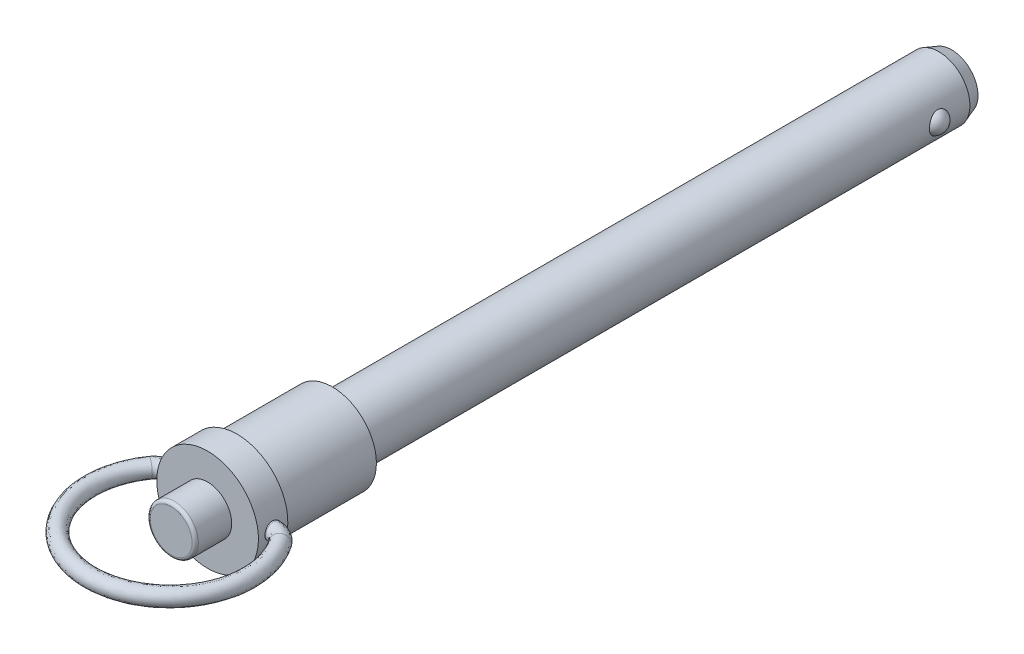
ISO-10303-21;
HEADER;
FILE_DESCRIPTION(('STEP AP214'),'2;1');
FILE_NAME('part.step','',(''),(''),'','','');
FILE_SCHEMA(('AUTOMOTIVE_DESIGN { 1 0 10303 214 1 1 1 1 }'));
ENDSEC;
DATA;
#1=APPLICATION_CONTEXT('core data for automotive mechanical design processes');
#2=APPLICATION_PROTOCOL_DEFINITION('international standard','automotive_design',2000,#1);
#3=PRODUCT_CONTEXT('',#1,'mechanical');
#4=PRODUCT('Part','Part','',(#3));
#5=PRODUCT_RELATED_PRODUCT_CATEGORY('part','',(#4));
#6=PRODUCT_DEFINITION_FORMATION('','',#4);
#7=PRODUCT_DEFINITION_CONTEXT('part definition',#1,'design');
#8=PRODUCT_DEFINITION('design','',#6,#7);
#9=PRODUCT_DEFINITION_SHAPE('','',#8);
#10=(LENGTH_UNIT() NAMED_UNIT(*) SI_UNIT(.MILLI.,.METRE.));
#11=(NAMED_UNIT(*) PLANE_ANGLE_UNIT() SI_UNIT($,.RADIAN.));
#12=(NAMED_UNIT(*) SI_UNIT($,.STERADIAN.) SOLID_ANGLE_UNIT());
#13=UNCERTAINTY_MEASURE_WITH_UNIT(LENGTH_MEASURE(1.E-05),#10,'distance_accuracy_value','');
#14=(GEOMETRIC_REPRESENTATION_CONTEXT(3) GLOBAL_UNCERTAINTY_ASSIGNED_CONTEXT((#13)) GLOBAL_UNIT_ASSIGNED_CONTEXT((#10,
#11,#12)) REPRESENTATION_CONTEXT('',''));
#15=CARTESIAN_POINT('',(0.,0.,0.));
#16=DIRECTION('',(0.,0.,1.));
#17=DIRECTION('',(1.,0.,0.));
#18=AXIS2_PLACEMENT_3D('',#15,#16,#17);
#19=CARTESIAN_POINT('',(0.,0.,25.765));
#20=DIRECTION('',(0.,0.,1.));
#21=DIRECTION('',(1.,0.,0.));
#22=AXIS2_PLACEMENT_3D('',#19,#20,#21);
#23=PLANE('',#22);
#24=CARTESIAN_POINT('',(0.,0.,25.765));
#25=DIRECTION('',(0.,0.,1.));
#26=DIRECTION('',(1.,0.,0.));
#27=AXIS2_PLACEMENT_3D('',#24,#25,#26);
#28=CIRCLE('',#27,3.3481);
#29=CARTESIAN_POINT('',(3.3481,0.,25.765));
#30=VERTEX_POINT('',#29);
#31=EDGE_CURVE('E141',#30,#30,#28,.T.);
#32=ORIENTED_EDGE('',*,*,#31,.T.);
#33=EDGE_LOOP('',(#32));
#34=FACE_BOUND('',#33,.T.);
#35=ADVANCED_FACE('F13',(#34),#23,.T.);
#36=CARTESIAN_POINT('',(0.,0.,25.265));
#37=DIRECTION('',(0.,0.,1.));
#38=DIRECTION('',(1.,0.,0.));
#39=AXIS2_PLACEMENT_3D('',#36,#37,#38);
#40=TOROIDAL_SURFACE('',#39,3.3481,0.5);
#41=CARTESIAN_POINT('',(0.,0.,25.265));
#42=DIRECTION('',(0.,0.,1.));
#43=DIRECTION('',(1.,0.,0.));
#44=AXIS2_PLACEMENT_3D('',#41,#42,#43);
#45=CIRCLE('',#44,3.8481);
#46=CARTESIAN_POINT('',(3.8481,0.,25.265));
#47=VERTEX_POINT('',#46);
#48=EDGE_CURVE('E138',#47,#47,#45,.T.);
#49=ORIENTED_EDGE('',*,*,#48,.T.);
#50=EDGE_LOOP('',(#49));
#51=FACE_BOUND('',#50,.T.);
#52=ORIENTED_EDGE('',*,*,#31,.F.);
#53=EDGE_LOOP('',(#52));
#54=FACE_BOUND('',#53,.T.);
#55=ADVANCED_FACE('F76',(#51,#54),#40,.T.);
#56=CARTESIAN_POINT('',(11.4497733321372,0.,17.9437724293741));
#57=CARTESIAN_POINT('',(11.8265676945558,0.,18.4801460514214));
#58=CARTESIAN_POINT('',(12.6551080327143,0.,19.8662433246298));
#59=CARTESIAN_POINT('',(13.4882796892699,0.,22.0133244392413));
#60=CARTESIAN_POINT('',(14.0014195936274,0.,24.4938075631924));
#61=CARTESIAN_POINT('',(14.0399868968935,0.,27.1482100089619));
#62=CARTESIAN_POINT('',(13.5501253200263,0.,29.8733661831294));
#63=CARTESIAN_POINT('',(12.5103672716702,0.,32.4943169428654));
#64=CARTESIAN_POINT('',(10.9649059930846,0.,34.8529407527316));
#65=CARTESIAN_POINT('',(9.01915526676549,0.,36.8217510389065));
#66=CARTESIAN_POINT('',(6.82219687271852,0.,38.3176313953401));
#67=CARTESIAN_POINT('',(4.51156788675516,0.,39.3254677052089));
#68=CARTESIAN_POINT('',(2.23137128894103,0.,39.879227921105));
#69=CARTESIAN_POINT('',(7.28333001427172E-13,0.,40.0580345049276));
#70=CARTESIAN_POINT('',(-2.23137128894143,0.,39.879227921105));
#71=CARTESIAN_POINT('',(-4.51156788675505,0.,39.3254677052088));
#72=CARTESIAN_POINT('',(-6.82219687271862,0.,38.31763139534));
#73=CARTESIAN_POINT('',(-9.01915526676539,0.,36.8217510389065));
#74=CARTESIAN_POINT('',(-10.9649059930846,0.,34.8529407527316));
#75=CARTESIAN_POINT('',(-12.5103672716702,0.,32.4943169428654));
#76=CARTESIAN_POINT('',(-13.5501253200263,0.,29.8733661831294));
#77=CARTESIAN_POINT('',(-14.0399868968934,0.,27.148210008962));
#78=CARTESIAN_POINT('',(-14.0014195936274,0.,24.4938075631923));
#79=CARTESIAN_POINT('',(-13.4882796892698,0.,22.0133244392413));
#80=CARTESIAN_POINT('',(-12.6551080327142,0.,19.8662433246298));
#81=CARTESIAN_POINT('',(-11.8265676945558,0.,18.4801460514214));
#82=CARTESIAN_POINT('',(-11.4497733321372,0.,17.9437724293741));
#83=CARTESIAN_POINT('',(11.4497733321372,-2.59999999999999,17.9437724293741));
#84=CARTESIAN_POINT('',(11.7096770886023,-2.59999999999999,18.3137501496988));
#85=CARTESIAN_POINT('',(12.7137877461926,-2.59999999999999,19.9497749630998));
#86=CARTESIAN_POINT('',(13.4708176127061,-2.59999999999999,21.9884668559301));
#87=CARTESIAN_POINT('',(14.0065482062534,-2.6,24.5011082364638));
#88=CARTESIAN_POINT('',(14.0385176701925,-2.59999999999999,27.1461185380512));
#89=CARTESIAN_POINT('',(13.5505344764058,-2.59999999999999,29.8739486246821));
#90=CARTESIAN_POINT('',(12.5102566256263,-2.59999999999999,32.4941594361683));
#91=CARTESIAN_POINT('',(10.9649350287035,-2.59999999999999,34.8529820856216));
#92=CARTESIAN_POINT('',(9.01914786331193,-2.6,36.8217404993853));
#93=CARTESIAN_POINT('',(6.82219870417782,-2.59999999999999,38.3176340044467));
#94=CARTESIAN_POINT('',(4.51156744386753,-2.59999999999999,39.3254670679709));
#95=CARTESIAN_POINT('',(2.23137138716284,-2.59999999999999,39.879228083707));
#96=CARTESIAN_POINT('',(7.28268272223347E-13,-2.59999999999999,40.0580344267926));
#97=CARTESIAN_POINT('',(-2.23137138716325,-2.6,39.879228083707));
#98=CARTESIAN_POINT('',(-4.51156744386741,-2.59999999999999,39.3254670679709));
#99=CARTESIAN_POINT('',(-6.82219870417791,-2.6,38.3176340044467));
#100=CARTESIAN_POINT('',(-9.01914786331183,-2.59999999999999,36.8217404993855));
#101=CARTESIAN_POINT('',(-10.9649350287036,-2.59999999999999,34.8529820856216));
#102=CARTESIAN_POINT('',(-12.5102566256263,-2.59999999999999,32.4941594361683));
#103=CARTESIAN_POINT('',(-13.5505344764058,-2.59999999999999,29.8739486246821));
#104=CARTESIAN_POINT('',(-14.0385176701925,-2.6,27.1461185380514));
#105=CARTESIAN_POINT('',(-14.0065482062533,-2.59999999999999,24.5011082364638));
#106=CARTESIAN_POINT('',(-13.4708176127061,-2.59999999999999,21.9884668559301));
#107=CARTESIAN_POINT('',(-12.7137877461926,-2.59999999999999,19.9497749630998));
#108=CARTESIAN_POINT('',(-11.7096770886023,-2.59999999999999,18.3137501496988));
#109=CARTESIAN_POINT('',(-11.4497733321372,-2.59999999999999,17.9437724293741));
#110=CARTESIAN_POINT('',(9.33442519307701,-2.59999999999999,19.4556422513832));
#111=CARTESIAN_POINT('',(9.59432894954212,-2.59999999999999,19.8256199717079));
#112=CARTESIAN_POINT('',(10.3328710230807,-2.59999999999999,21.0505437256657));
#113=CARTESIAN_POINT('',(10.9823054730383,-2.59999999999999,22.7644201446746));
#114=CARTESIAN_POINT('',(11.4042672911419,-2.6,24.7888114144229));
#115=CARTESIAN_POINT('',(11.4306312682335,-2.59999999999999,26.9493701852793));
#116=CARTESIAN_POINT('',(11.0308912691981,-2.59999999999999,29.1626260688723));
#117=CARTESIAN_POINT('',(10.1828123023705,-2.59999999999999,31.2968985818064));
#118=CARTESIAN_POINT('',(8.92160036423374,-2.59999999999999,33.2166725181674));
#119=CARTESIAN_POINT('',(7.34098330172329,-2.6,34.8144779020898));
#120=CARTESIAN_POINT('',(5.5491258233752,-2.59999999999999,36.0332448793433));
#121=CARTESIAN_POINT('',(3.67550207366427,-2.59999999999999,36.8497543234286));
#122=CARTESIAN_POINT('',(1.8109997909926,-2.59999999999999,37.3021941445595));
#123=CARTESIAN_POINT('',(-9.61358135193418E-13,-2.59999999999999,37.4469985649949));
#124=CARTESIAN_POINT('',(-1.81099979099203,-2.6,37.3021941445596));
#125=CARTESIAN_POINT('',(-3.6755020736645,-2.59999999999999,36.8497543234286));
#126=CARTESIAN_POINT('',(-5.54912582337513,-2.6,36.0332448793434));
#127=CARTESIAN_POINT('',(-7.34098330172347,-2.59999999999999,34.8144779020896));
#128=CARTESIAN_POINT('',(-8.92160036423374,-2.59999999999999,33.2166725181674));
#129=CARTESIAN_POINT('',(-10.1828123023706,-2.59999999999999,31.2968985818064));
#130=CARTESIAN_POINT('',(-11.0308912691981,-2.59999999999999,29.1626260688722));
#131=CARTESIAN_POINT('',(-11.4306312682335,-2.6,26.9493701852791));
#132=CARTESIAN_POINT('',(-11.4042672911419,-2.59999999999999,24.7888114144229));
#133=CARTESIAN_POINT('',(-10.9823054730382,-2.59999999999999,22.7644201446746));
#134=CARTESIAN_POINT('',(-10.3328710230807,-2.59999999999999,21.0505437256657));
#135=CARTESIAN_POINT('',(-9.59432894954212,-2.59999999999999,19.8256199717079));
#136=CARTESIAN_POINT('',(-9.33442519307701,-2.59999999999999,19.4556422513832));
#137=CARTESIAN_POINT('',(9.33442519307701,0.,19.4556422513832));
#138=CARTESIAN_POINT('',(9.65277425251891,0.,19.9088179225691));
#139=CARTESIAN_POINT('',(10.3035311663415,0.,21.0087779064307));
#140=CARTESIAN_POINT('',(10.9910365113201,0.,22.7768489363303));
#141=CARTESIAN_POINT('',(11.4017029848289,0.,24.7851610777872));
#142=CARTESIAN_POINT('',(11.431365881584,0.,26.9504159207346));
#143=CARTESIAN_POINT('',(11.0306866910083,0.,29.1623348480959));
#144=CARTESIAN_POINT('',(10.1828676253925,0.,31.2969773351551));
#145=CARTESIAN_POINT('',(8.92158584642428,0.,33.2166518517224));
#146=CARTESIAN_POINT('',(7.34098700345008,0.,34.8144831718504));
#147=CARTESIAN_POINT('',(5.54912490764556,0.,36.03324357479));
#148=CARTESIAN_POINT('',(3.67550229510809,0.,36.8497546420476));
#149=CARTESIAN_POINT('',(1.8109997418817,0.,37.3021940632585));
#150=CARTESIAN_POINT('',(-9.6127182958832E-13,0.,37.4469986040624));
#151=CARTESIAN_POINT('',(-1.81099974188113,0.,37.3021940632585));
#152=CARTESIAN_POINT('',(-3.67550229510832,0.,36.8497546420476));
#153=CARTESIAN_POINT('',(-5.54912490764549,0.,36.03324357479));
#154=CARTESIAN_POINT('',(-7.34098700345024,0.,34.8144831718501));
#155=CARTESIAN_POINT('',(-8.92158584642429,0.,33.2166518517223));
#156=CARTESIAN_POINT('',(-10.1828676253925,0.,31.296977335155));
#157=CARTESIAN_POINT('',(-11.0306866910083,0.,29.1623348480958));
#158=CARTESIAN_POINT('',(-11.431365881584,0.,26.9504159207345));
#159=CARTESIAN_POINT('',(-11.4017029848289,0.,24.7851610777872));
#160=CARTESIAN_POINT('',(-10.9910365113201,0.,22.7768489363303));
#161=CARTESIAN_POINT('',(-10.3035311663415,0.,21.0087779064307));
#162=CARTESIAN_POINT('',(-9.6527742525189,0.,19.9088179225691));
#163=CARTESIAN_POINT('',(-9.33442519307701,0.,19.4556422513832));
#164=CARTESIAN_POINT('',(9.33442519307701,2.59999999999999,19.4556422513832));
#165=CARTESIAN_POINT('',(9.7112195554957,2.59999999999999,19.9920158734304));
#166=CARTESIAN_POINT('',(10.2741913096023,2.59999999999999,20.9670120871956));
#167=CARTESIAN_POINT('',(10.999767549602,2.59999999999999,22.7892777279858));
#168=CARTESIAN_POINT('',(11.3991386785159,2.6,24.7815107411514));
#169=CARTESIAN_POINT('',(11.4321004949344,2.59999999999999,26.9514616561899));
#170=CARTESIAN_POINT('',(11.0304821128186,2.59999999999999,29.1620436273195));
#171=CARTESIAN_POINT('',(10.1829229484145,2.59999999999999,31.2970560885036));
#172=CARTESIAN_POINT('',(8.92157132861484,2.59999999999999,33.2166311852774));
#173=CARTESIAN_POINT('',(7.34099070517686,2.6,34.8144884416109));
#174=CARTESIAN_POINT('',(5.54912399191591,2.59999999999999,36.0332422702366));
#175=CARTESIAN_POINT('',(3.67550251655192,2.59999999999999,36.8497549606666));
#176=CARTESIAN_POINT('',(1.81099969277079,2.59999999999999,37.3021939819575));
#177=CARTESIAN_POINT('',(-9.61422864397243E-13,2.59999999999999,37.4469986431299));
#178=CARTESIAN_POINT('',(-1.81099969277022,2.6,37.3021939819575));
#179=CARTESIAN_POINT('',(-3.67550251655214,2.59999999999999,36.8497549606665));
#180=CARTESIAN_POINT('',(-5.54912399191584,2.6,36.0332422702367));
#181=CARTESIAN_POINT('',(-7.34099070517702,2.59999999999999,34.8144884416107));
#182=CARTESIAN_POINT('',(-8.92157132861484,2.59999999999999,33.2166311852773));
#183=CARTESIAN_POINT('',(-10.1829229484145,2.59999999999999,31.2970560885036));
#184=CARTESIAN_POINT('',(-11.0304821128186,2.59999999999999,29.1620436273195));
#185=CARTESIAN_POINT('',(-11.4321004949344,2.6,26.9514616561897));
#186=CARTESIAN_POINT('',(-11.3991386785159,2.59999999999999,24.7815107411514));
#187=CARTESIAN_POINT('',(-10.999767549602,2.59999999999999,22.7892777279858));
#188=CARTESIAN_POINT('',(-10.2741913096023,2.59999999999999,20.9670120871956));
#189=CARTESIAN_POINT('',(-9.71121955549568,2.59999999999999,19.9920158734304));
#190=CARTESIAN_POINT('',(-9.33442519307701,2.59999999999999,19.4556422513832));
#191=CARTESIAN_POINT('',(11.4497733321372,2.59999999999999,17.9437724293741));
#192=CARTESIAN_POINT('',(11.9434583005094,2.59999999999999,18.6465419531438));
#193=CARTESIAN_POINT('',(12.5964283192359,2.59999999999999,19.7827116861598));
#194=CARTESIAN_POINT('',(13.5057417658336,2.59999999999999,22.0381820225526));
#195=CARTESIAN_POINT('',(13.9962909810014,2.6,24.4865068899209));
#196=CARTESIAN_POINT('',(14.0414561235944,2.59999999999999,27.1503014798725));
#197=CARTESIAN_POINT('',(13.5497161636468,2.59999999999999,29.8727837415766));
#198=CARTESIAN_POINT('',(12.5104779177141,2.59999999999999,32.4944744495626));
#199=CARTESIAN_POINT('',(10.9648769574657,2.59999999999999,34.8528994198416));
#200=CARTESIAN_POINT('',(9.01916267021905,2.6,36.8217615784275));
#201=CARTESIAN_POINT('',(6.82219504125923,2.59999999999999,38.3176287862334));
#202=CARTESIAN_POINT('',(4.5115683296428,2.59999999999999,39.3254683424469));
#203=CARTESIAN_POINT('',(2.23137119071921,2.59999999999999,39.8792277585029));
#204=CARTESIAN_POINT('',(7.28203543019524E-13,2.59999999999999,40.0580345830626));
#205=CARTESIAN_POINT('',(-2.23137119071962,2.6,39.879227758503));
#206=CARTESIAN_POINT('',(-4.51156832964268,2.59999999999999,39.3254683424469));
#207=CARTESIAN_POINT('',(-6.82219504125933,2.6,38.3176287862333));
#208=CARTESIAN_POINT('',(-9.01916267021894,2.59999999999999,36.8217615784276));
#209=CARTESIAN_POINT('',(-10.9648769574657,2.59999999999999,34.8528994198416));
#210=CARTESIAN_POINT('',(-12.5104779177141,2.59999999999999,32.4944744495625));
#211=CARTESIAN_POINT('',(-13.5497161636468,2.59999999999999,29.8727837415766));
#212=CARTESIAN_POINT('',(-14.0414561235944,2.6,27.1503014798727));
#213=CARTESIAN_POINT('',(-13.9962909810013,2.59999999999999,24.4865068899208));
#214=CARTESIAN_POINT('',(-13.5057417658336,2.59999999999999,22.0381820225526));
#215=CARTESIAN_POINT('',(-12.5964283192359,2.59999999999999,19.7827116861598));
#216=CARTESIAN_POINT('',(-11.9434583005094,2.59999999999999,18.6465419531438));
#217=CARTESIAN_POINT('',(-11.4497733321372,2.59999999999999,17.9437724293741));
#218=CARTESIAN_POINT('',(11.4497733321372,0.,17.9437724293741));
#219=CARTESIAN_POINT('',(11.8265676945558,0.,18.4801460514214));
#220=CARTESIAN_POINT('',(12.6551080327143,0.,19.8662433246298));
#221=CARTESIAN_POINT('',(13.4882796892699,0.,22.0133244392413));
#222=CARTESIAN_POINT('',(14.0014195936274,0.,24.4938075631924));
#223=CARTESIAN_POINT('',(14.0399868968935,0.,27.1482100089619));
#224=CARTESIAN_POINT('',(13.5501253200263,0.,29.8733661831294));
#225=CARTESIAN_POINT('',(12.5103672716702,0.,32.4943169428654));
#226=CARTESIAN_POINT('',(10.9649059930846,0.,34.8529407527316));
#227=CARTESIAN_POINT('',(9.01915526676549,0.,36.8217510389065));
#228=CARTESIAN_POINT('',(6.82219687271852,0.,38.3176313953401));
#229=CARTESIAN_POINT('',(4.51156788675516,0.,39.3254677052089));
#230=CARTESIAN_POINT('',(2.23137128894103,0.,39.879227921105));
#231=CARTESIAN_POINT('',(7.28333001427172E-13,0.,40.0580345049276));
#232=CARTESIAN_POINT('',(-2.23137128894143,0.,39.879227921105));
#233=CARTESIAN_POINT('',(-4.51156788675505,0.,39.3254677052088));
#234=CARTESIAN_POINT('',(-6.82219687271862,0.,38.31763139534));
#235=CARTESIAN_POINT('',(-9.01915526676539,0.,36.8217510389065));
#236=CARTESIAN_POINT('',(-10.9649059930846,0.,34.8529407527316));
#237=CARTESIAN_POINT('',(-12.5103672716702,0.,32.4943169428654));
#238=CARTESIAN_POINT('',(-13.5501253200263,0.,29.8733661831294));
#239=CARTESIAN_POINT('',(-14.0399868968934,0.,27.148210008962));
#240=CARTESIAN_POINT('',(-14.0014195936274,0.,24.4938075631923));
#241=CARTESIAN_POINT('',(-13.4882796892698,0.,22.0133244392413));
#242=CARTESIAN_POINT('',(-12.6551080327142,0.,19.8662433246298));
#243=CARTESIAN_POINT('',(-11.8265676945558,0.,18.4801460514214));
#244=CARTESIAN_POINT('',(-11.4497733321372,0.,17.9437724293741));
#245=(BOUNDED_SURFACE() B_SPLINE_SURFACE(3,3,((#56,#57,#58,#59,#60,#61,#62,#63,#64,#65,#66,#67,
#68,#69,#70,#71,#72,#73,#74,#75,#76,#77,#78,#79,#80,#81,#82),(#83,#84,#85,#86,#87,#88,#89,#90,
#91,#92,#93,#94,#95,#96,#97,#98,#99,#100,#101,#102,#103,#104,#105,#106,#107,#108,#109),(#110,
#111,#112,#113,#114,#115,#116,#117,#118,#119,#120,#121,#122,#123,#124,#125,#126,#127,#128,#129,
#130,#131,#132,#133,#134,#135,#136),(#137,#138,#139,#140,#141,#142,#143,#144,#145,#146,#147,
#148,#149,#150,#151,#152,#153,#154,#155,#156,#157,#158,#159,#160,#161,#162,#163),(#164,#165,
#166,#167,#168,#169,#170,#171,#172,#173,#174,#175,#176,#177,#178,#179,#180,#181,#182,#183,#184,
#185,#186,#187,#188,#189,#190),(#191,#192,#193,#194,#195,#196,#197,#198,#199,#200,#201,#202,
#203,#204,#205,#206,#207,#208,#209,#210,#211,#212,#213,#214,#215,#216,#217),(#218,#219,#220,
#221,#222,#223,#224,#225,#226,#227,#228,#229,#230,#231,#232,#233,#234,#235,#236,#237,#238,#239,
#240,#241,#242,#243,#244)),.UNSPECIFIED.,.T.,.F.,.F.) B_SPLINE_SURFACE_WITH_KNOTS((4,3,4),(4,1,
1,1,1,1,1,1,1,1,1,1,1,1,1,1,1,1,1,1,1,1,1,1,4),(0.,0.5,1.),(0.,0.0355177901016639,
0.0739139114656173,0.114982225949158,0.158533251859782,0.203808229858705,0.250000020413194,
0.296191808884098,0.34146678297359,0.385017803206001,0.426086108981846,0.464482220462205,0.5,
0.535517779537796,0.573913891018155,0.614982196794,0.658533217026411,0.703808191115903,
0.749999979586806,0.796191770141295,0.841466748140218,0.885017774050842,0.926086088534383,
0.964482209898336,1.),
.UNSPECIFIED.) GEOMETRIC_REPRESENTATION_ITEM() RATIONAL_B_SPLINE_SURFACE(((1.,1.,1.,1.,1.,1.,1.,
1.,1.,1.,1.,1.,1.,1.,1.,1.,1.,1.,1.,1.,1.,1.,1.,1.,1.,1.,1.),(0.333333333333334,
0.333333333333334,0.333333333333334,0.333333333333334,0.333333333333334,0.333333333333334,
0.333333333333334,0.333333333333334,0.333333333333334,0.333333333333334,0.333333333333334,
0.333333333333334,0.333333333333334,0.333333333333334,0.333333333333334,0.333333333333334,
0.333333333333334,0.333333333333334,0.333333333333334,0.333333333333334,0.333333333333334,
0.333333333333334,0.333333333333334,0.333333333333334,0.333333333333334,0.333333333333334,
0.333333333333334),(0.333333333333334,0.333333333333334,0.333333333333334,0.333333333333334,
0.333333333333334,0.333333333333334,0.333333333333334,0.333333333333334,0.333333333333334,
0.333333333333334,0.333333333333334,0.333333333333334,0.333333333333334,0.333333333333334,
0.333333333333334,0.333333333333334,0.333333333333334,0.333333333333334,0.333333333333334,
0.333333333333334,0.333333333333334,0.333333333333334,0.333333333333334,0.333333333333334,
0.333333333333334,0.333333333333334,0.333333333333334),(1.,1.,1.,1.,1.,1.,1.,1.,1.,1.,1.,1.,1.,
1.,1.,1.,1.,1.,1.,1.,1.,1.,1.,1.,1.,1.,1.),(0.333333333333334,0.333333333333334,
0.333333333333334,0.333333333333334,0.333333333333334,0.333333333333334,0.333333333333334,
0.333333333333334,0.333333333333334,0.333333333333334,0.333333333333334,0.333333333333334,
0.333333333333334,0.333333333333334,0.333333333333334,0.333333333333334,0.333333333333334,
0.333333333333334,0.333333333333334,0.333333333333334,0.333333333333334,0.333333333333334,
0.333333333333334,0.333333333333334,0.333333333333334,0.333333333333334,0.333333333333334),
(0.333333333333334,0.333333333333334,0.333333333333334,0.333333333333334,0.333333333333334,
0.333333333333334,0.333333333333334,0.333333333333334,0.333333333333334,0.333333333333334,
0.333333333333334,0.333333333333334,0.333333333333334,0.333333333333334,0.333333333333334,
0.333333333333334,0.333333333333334,0.333333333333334,0.333333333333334,0.333333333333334,
0.333333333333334,0.333333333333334,0.333333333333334,0.333333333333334,0.333333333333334,
0.333333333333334,0.333333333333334),(1.,1.,1.,1.,1.,1.,1.,1.,1.,1.,1.,1.,1.,1.,1.,1.,1.,1.,1.,
1.,1.,1.,1.,1.,1.,1.,1.))) REPRESENTATION_ITEM('') SURFACE());
#246=CARTESIAN_POINT('',(11.4497733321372,0.,17.9437724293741));
#247=CARTESIAN_POINT('',(11.4497733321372,-2.59999999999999,17.9437724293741));
#248=CARTESIAN_POINT('',(9.33442519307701,-2.59999999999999,19.4556422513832));
#249=CARTESIAN_POINT('',(9.33442519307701,0.,19.4556422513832));
#250=CARTESIAN_POINT('',(9.33442519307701,2.59999999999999,19.4556422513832));
#251=CARTESIAN_POINT('',(11.4497733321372,2.59999999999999,17.9437724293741));
#252=CARTESIAN_POINT('',(11.4497733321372,0.,17.9437724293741));
#253=(BOUNDED_CURVE() B_SPLINE_CURVE(3,(#246,#247,#248,#249,#250,#251,#252),.UNSPECIFIED.,.T.,
.F.) B_SPLINE_CURVE_WITH_KNOTS((4,3,4),(0.,0.5,1.),
.UNSPECIFIED.) CURVE() GEOMETRIC_REPRESENTATION_ITEM() RATIONAL_B_SPLINE_CURVE((1.,
0.333333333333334,0.333333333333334,1.,0.333333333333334,0.333333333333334,1.)) REPRESENTATION_ITEM(''));
#254=CARTESIAN_POINT('',(11.4497733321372,0.,17.9437724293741));
#255=VERTEX_POINT('',#254);
#256=EDGE_CURVE('E176',#255,#255,#253,.T.);
#257=CARTESIAN_POINT('',(-11.4497733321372,0.,17.9437724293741));
#258=CARTESIAN_POINT('',(-11.4497733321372,-2.59999999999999,17.9437724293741));
#259=CARTESIAN_POINT('',(-9.33442519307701,-2.59999999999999,19.4556422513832));
#260=CARTESIAN_POINT('',(-9.33442519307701,0.,19.4556422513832));
#261=CARTESIAN_POINT('',(-9.33442519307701,2.59999999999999,19.4556422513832));
#262=CARTESIAN_POINT('',(-11.4497733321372,2.59999999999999,17.9437724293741));
#263=CARTESIAN_POINT('',(-11.4497733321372,0.,17.9437724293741));
#264=(BOUNDED_CURVE() B_SPLINE_CURVE(3,(#257,#258,#259,#260,#261,#262,#263),.UNSPECIFIED.,.T.,
.F.) B_SPLINE_CURVE_WITH_KNOTS((4,3,4),(0.,0.5,1.),
.UNSPECIFIED.) CURVE() GEOMETRIC_REPRESENTATION_ITEM() RATIONAL_B_SPLINE_CURVE((1.,
0.333333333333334,0.333333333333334,1.,0.333333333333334,0.333333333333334,1.)) REPRESENTATION_ITEM(''));
#265=CARTESIAN_POINT('',(-11.4497733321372,0.,17.9437724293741));
#266=VERTEX_POINT('',#265);
#267=EDGE_CURVE('E174',#266,#266,#264,.F.);
#268=ORIENTED_EDGE('',*,*,#256,.F.);
#269=EDGE_LOOP('',(#268));
#270=FACE_BOUND('',#269,.T.);
#271=ORIENTED_EDGE('',*,*,#267,.F.);
#272=EDGE_LOOP('',(#271));
#273=FACE_BOUND('',#272,.T.);
#274=ADVANCED_FACE('F82',(#270,#273),#245,.F.);
#275=CARTESIAN_POINT('',(8.23717073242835,0.,16.3022));
#276=CARTESIAN_POINT('',(8.39026579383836,0.,16.3022));
#277=CARTESIAN_POINT('',(8.96971374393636,0.,16.3453113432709));
#278=CARTESIAN_POINT('',(9.59211406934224,0.,16.5211040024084));
#279=CARTESIAN_POINT('',(10.3031381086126,0.,16.8555507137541));
#280=CARTESIAN_POINT('',(10.8955792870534,0.,17.2786190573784));
#281=CARTESIAN_POINT('',(11.3434296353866,0.,17.7975125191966));
#282=CARTESIAN_POINT('',(11.4497733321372,0.,17.9437724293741));
#283=CARTESIAN_POINT('',(8.23717073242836,2.59999999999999,16.3022));
#284=CARTESIAN_POINT('',(8.16213736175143,2.59999999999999,16.3022));
#285=CARTESIAN_POINT('',(9.0792865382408,2.59999999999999,16.3469383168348));
#286=CARTESIAN_POINT('',(9.55822083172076,2.6,16.5152316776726));
#287=CARTESIAN_POINT('',(10.3298909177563,2.59999999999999,16.879237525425));
#288=CARTESIAN_POINT('',(10.8172738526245,2.59999999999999,17.1748054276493));
#289=CARTESIAN_POINT('',(11.5008843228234,2.59999999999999,18.0140679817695));
#290=CARTESIAN_POINT('',(11.4497733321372,2.59999999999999,17.9437724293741));
#291=CARTESIAN_POINT('',(8.23717073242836,2.59999999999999,18.9022));
#292=CARTESIAN_POINT('',(8.16213736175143,2.59999999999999,18.9022));
#293=CARTESIAN_POINT('',(8.54034086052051,2.59999999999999,18.9167455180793));
#294=CARTESIAN_POINT('',(8.68812752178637,2.6,18.9762506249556));
#295=CARTESIAN_POINT('',(8.94759350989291,2.59999999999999,19.0969960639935));
#296=CARTESIAN_POINT('',(9.10292826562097,2.59999999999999,19.1770581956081));
#297=CARTESIAN_POINT('',(9.38553618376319,2.59999999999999,19.5259378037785));
#298=CARTESIAN_POINT('',(9.33442519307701,2.59999999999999,19.4556422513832));
#299=CARTESIAN_POINT('',(8.23717073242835,0.,18.9022));
#300=CARTESIAN_POINT('',(8.2762015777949,0.,18.9022));
#301=CARTESIAN_POINT('',(8.48555446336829,0.,18.9159320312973));
#302=CARTESIAN_POINT('',(8.70507414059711,0.,18.9791867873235));
#303=CARTESIAN_POINT('',(8.93421710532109,0.,19.0851526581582));
#304=CARTESIAN_POINT('',(9.14208098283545,0.,19.2289650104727));
#305=CARTESIAN_POINT('',(9.30680884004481,0.,19.4176600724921));
#306=CARTESIAN_POINT('',(9.33442519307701,0.,19.4556422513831));
#307=CARTESIAN_POINT('',(8.23717073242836,-2.59999999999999,18.9022));
#308=CARTESIAN_POINT('',(8.39026579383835,-2.59999999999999,18.9022));
#309=CARTESIAN_POINT('',(8.43076806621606,-2.59999999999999,18.9151185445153));
#310=CARTESIAN_POINT('',(8.72202075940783,-2.6,18.9821229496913));
#311=CARTESIAN_POINT('',(8.92084070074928,-2.59999999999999,19.0733092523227));
#312=CARTESIAN_POINT('',(9.1812337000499,-2.59999999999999,19.2808718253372));
#313=CARTESIAN_POINT('',(9.22808149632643,-2.59999999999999,19.3093823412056));
#314=CARTESIAN_POINT('',(9.33442519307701,-2.59999999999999,19.4556422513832));
#315=CARTESIAN_POINT('',(8.23717073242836,-2.59999999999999,16.3022));
#316=CARTESIAN_POINT('',(8.61839422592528,-2.59999999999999,16.3022));
#317=CARTESIAN_POINT('',(8.8601409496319,-2.59999999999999,16.3436843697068));
#318=CARTESIAN_POINT('',(9.6260073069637,-2.6,16.5269763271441));
#319=CARTESIAN_POINT('',(10.276385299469,-2.59999999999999,16.8318639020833));
#320=CARTESIAN_POINT('',(10.9738847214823,-2.59999999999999,17.3824326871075));
#321=CARTESIAN_POINT('',(11.1859749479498,-2.59999999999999,17.5809570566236));
#322=CARTESIAN_POINT('',(11.4497733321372,-2.59999999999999,17.9437724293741));
#323=CARTESIAN_POINT('',(8.23717073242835,0.,16.3022));
#324=CARTESIAN_POINT('',(8.39026579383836,0.,16.3022));
#325=CARTESIAN_POINT('',(8.96971374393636,0.,16.3453113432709));
#326=CARTESIAN_POINT('',(9.59211406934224,0.,16.5211040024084));
#327=CARTESIAN_POINT('',(10.3031381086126,0.,16.8555507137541));
#328=CARTESIAN_POINT('',(10.8955792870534,0.,17.2786190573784));
#329=CARTESIAN_POINT('',(11.3434296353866,0.,17.7975125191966));
#330=CARTESIAN_POINT('',(11.4497733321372,0.,17.9437724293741));
#331=(BOUNDED_SURFACE() B_SPLINE_SURFACE(3,3,((#275,#276,#277,#278,#279,#280,#281,#282),(#283,
#284,#285,#286,#287,#288,#289,#290),(#291,#292,#293,#294,#295,#296,#297,#298),(#299,#300,#301,
#302,#303,#304,#305,#306),(#307,#308,#309,#310,#311,#312,#313,#314),(#315,#316,#317,#318,#319,
#320,#321,#322),(#323,#324,#325,#326,#327,#328,#329,#330)),.UNSPECIFIED.,.T.,.F.,
.F.) B_SPLINE_SURFACE_WITH_KNOTS((4,3,4),(4,1,1,1,1,4),(0.,0.5,1.),(0.,0.183393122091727,
0.371127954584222,0.561360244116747,0.78346967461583,1.),
.UNSPECIFIED.) GEOMETRIC_REPRESENTATION_ITEM() RATIONAL_B_SPLINE_SURFACE(((1.,1.,1.,1.,1.,1.,1.,
1.),(0.333333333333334,0.333333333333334,0.333333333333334,0.333333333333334,0.333333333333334,
0.333333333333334,0.333333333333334,0.333333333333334),(0.333333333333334,0.333333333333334,
0.333333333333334,0.333333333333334,0.333333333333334,0.333333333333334,0.333333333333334,
0.333333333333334),(1.,1.,1.,1.,1.,1.,1.,1.),(0.333333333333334,0.333333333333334,
0.333333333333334,0.333333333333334,0.333333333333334,0.333333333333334,0.333333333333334,
0.333333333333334),(0.333333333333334,0.333333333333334,0.333333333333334,0.333333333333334,
0.333333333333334,0.333333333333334,0.333333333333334,0.333333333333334),(1.,1.,1.,1.,1.,1.,1.,1.))) REPRESENTATION_ITEM('') SURFACE());
#332=CARTESIAN_POINT('',(8.23717073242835,0.,17.6022));
#333=DIRECTION('',(1.,0.,0.));
#334=DIRECTION('',(0.,0.,-1.));
#335=AXIS2_PLACEMENT_3D('',#332,#333,#334);
#336=CIRCLE('',#335,1.3);
#337=CARTESIAN_POINT('',(8.23717073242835,0.,16.3022));
#338=VERTEX_POINT('',#337);
#339=EDGE_CURVE('E112',#338,#338,#336,.T.);
#340=ORIENTED_EDGE('',*,*,#339,.T.);
#341=EDGE_LOOP('',(#340));
#342=FACE_BOUND('',#341,.T.);
#343=ORIENTED_EDGE('',*,*,#256,.T.);
#344=EDGE_LOOP('',(#343));
#345=FACE_BOUND('',#344,.T.);
#346=ADVANCED_FACE('F92',(#342,#345),#331,.T.);
#347=CARTESIAN_POINT('',(0.,0.,24.765));
#348=DIRECTION('',(0.,0.,-1.));
#349=DIRECTION('',(0.,1.,0.));
#350=AXIS2_PLACEMENT_3D('',#347,#348,#349);
#351=CYLINDRICAL_SURFACE('',#350,3.8481);
#352=CARTESIAN_POINT('',(0.,0.,19.939));
#353=DIRECTION('',(0.,0.,-1.));
#354=DIRECTION('',(0.,1.,0.));
#355=AXIS2_PLACEMENT_3D('',#352,#353,#354);
#356=CIRCLE('',#355,3.8481);
#357=CARTESIAN_POINT('',(0.,3.8481,19.939));
#358=VERTEX_POINT('',#357);
#359=EDGE_CURVE('E148',#358,#358,#356,.T.);
#360=ORIENTED_EDGE('',*,*,#359,.F.);
#361=EDGE_LOOP('',(#360));
#362=FACE_BOUND('',#361,.T.);
#363=ORIENTED_EDGE('',*,*,#48,.F.);
#364=EDGE_LOOP('',(#363));
#365=FACE_BOUND('',#364,.T.);
#366=ADVANCED_FACE('F88',(#362,#365),#351,.T.);
#367=CARTESIAN_POINT('',(-11.4497733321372,0.,17.9437724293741));
#368=CARTESIAN_POINT('',(-11.3597411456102,0.,17.8199465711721));
#369=CARTESIAN_POINT('',(-10.985804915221,0.,17.3752654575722));
#370=CARTESIAN_POINT('',(-10.4784291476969,0.,16.9741029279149));
#371=CARTESIAN_POINT('',(-9.7908926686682,0.,16.5936956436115));
#372=CARTESIAN_POINT('',(-9.10089921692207,0.,16.3618307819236));
#373=CARTESIAN_POINT('',(-8.41800257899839,0.,16.3022));
#374=CARTESIAN_POINT('',(-8.23717073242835,0.,16.3022));
#375=CARTESIAN_POINT('',(-11.4497733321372,2.59999999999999,17.9437724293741));
#376=CARTESIAN_POINT('',(-11.4938947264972,2.59999999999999,18.0044548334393));
#377=CARTESIAN_POINT('',(-10.9200537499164,2.59999999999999,17.2876012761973));
#378=CARTESIAN_POINT('',(-10.503110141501,2.6,16.9980618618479));
#379=CARTESIAN_POINT('',(-9.75600116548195,2.59999999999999,16.585987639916));
#380=CARTESIAN_POINT('',(-9.23091765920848,2.59999999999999,16.3641146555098));
#381=CARTESIAN_POINT('',(-8.15024985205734,2.59999999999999,16.3022));
#382=CARTESIAN_POINT('',(-8.23717073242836,2.59999999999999,16.3022));
#383=CARTESIAN_POINT('',(-9.33442519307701,2.59999999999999,19.4556422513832));
#384=CARTESIAN_POINT('',(-9.37854658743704,2.59999999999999,19.5163246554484));
#385=CARTESIAN_POINT('',(-9.14268985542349,2.59999999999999,19.2203693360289));
#386=CARTESIAN_POINT('',(-9.00682479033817,2.6,19.1369648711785));
#387=CARTESIAN_POINT('',(-8.7554763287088,2.59999999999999,19.0001197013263));
#388=CARTESIAN_POINT('',(-8.59879927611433,2.59999999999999,18.9230559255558));
#389=CARTESIAN_POINT('',(-8.15024985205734,2.59999999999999,18.9022));
#390=CARTESIAN_POINT('',(-8.23717073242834,2.59999999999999,18.9022));
#391=CARTESIAN_POINT('',(-9.334425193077,0.,19.4556422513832));
#392=CARTESIAN_POINT('',(-9.31146979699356,0.,19.4240705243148));
#393=CARTESIAN_POINT('',(-9.17556543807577,0.,19.2642014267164));
#394=CARTESIAN_POINT('',(-8.99448429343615,0.,19.124985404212));
#395=CARTESIAN_POINT('',(-8.77292208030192,0.,19.0039737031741));
#396=CARTESIAN_POINT('',(-8.53379005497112,0.,18.9219139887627));
#397=CARTESIAN_POINT('',(-8.28412621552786,0.,18.9022));
#398=CARTESIAN_POINT('',(-8.23717073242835,0.,18.9022));
#399=CARTESIAN_POINT('',(-9.33442519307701,-2.59999999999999,19.4556422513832));
#400=CARTESIAN_POINT('',(-9.24439300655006,-2.59999999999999,19.3318163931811));
#401=CARTESIAN_POINT('',(-9.20844102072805,-2.59999999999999,19.3080335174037));
#402=CARTESIAN_POINT('',(-8.98214379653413,-2.6,19.1130059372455));
#403=CARTESIAN_POINT('',(-8.79036783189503,-2.59999999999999,19.0078277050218));
#404=CARTESIAN_POINT('',(-8.46878083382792,-2.59999999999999,18.9207720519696));
#405=CARTESIAN_POINT('',(-8.41800257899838,-2.59999999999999,18.9022));
#406=CARTESIAN_POINT('',(-8.23717073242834,-2.59999999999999,18.9022));
#407=CARTESIAN_POINT('',(-11.4497733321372,-2.59999999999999,17.9437724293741));
#408=CARTESIAN_POINT('',(-11.2255875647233,-2.59999999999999,17.6354383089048));
#409=CARTESIAN_POINT('',(-11.0515560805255,-2.59999999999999,17.4629296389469));
#410=CARTESIAN_POINT('',(-10.4537481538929,-2.6,16.9501439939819));
#411=CARTESIAN_POINT('',(-9.82578417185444,-2.59999999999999,16.6014036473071));
#412=CARTESIAN_POINT('',(-8.97088077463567,-2.59999999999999,16.3595469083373));
#413=CARTESIAN_POINT('',(-8.68575530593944,-2.59999999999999,16.3022));
#414=CARTESIAN_POINT('',(-8.23717073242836,-2.59999999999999,16.3022));
#415=CARTESIAN_POINT('',(-11.4497733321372,0.,17.9437724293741));
#416=CARTESIAN_POINT('',(-11.3597411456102,0.,17.8199465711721));
#417=CARTESIAN_POINT('',(-10.985804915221,0.,17.3752654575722));
#418=CARTESIAN_POINT('',(-10.4784291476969,0.,16.9741029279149));
#419=CARTESIAN_POINT('',(-9.7908926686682,0.,16.5936956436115));
#420=CARTESIAN_POINT('',(-9.10089921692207,0.,16.3618307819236));
#421=CARTESIAN_POINT('',(-8.41800257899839,0.,16.3022));
#422=CARTESIAN_POINT('',(-8.23717073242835,0.,16.3022));
#423=(BOUNDED_SURFACE() B_SPLINE_SURFACE(3,3,((#367,#368,#369,#370,#371,#372,#373,#374),(#375,
#376,#377,#378,#379,#380,#381,#382),(#383,#384,#385,#386,#387,#388,#389,#390),(#391,#392,#393,
#394,#395,#396,#397,#398),(#399,#400,#401,#402,#403,#404,#405,#406),(#407,#408,#409,#410,#411,
#412,#413,#414),(#415,#416,#417,#418,#419,#420,#421,#422)),.UNSPECIFIED.,.T.,.F.,
.F.) B_SPLINE_SURFACE_WITH_KNOTS((4,3,4),(4,1,1,1,1,4),(0.,0.5,1.),(0.,0.183394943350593,
0.371130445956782,0.561362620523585,0.783471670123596,1.),
.UNSPECIFIED.) GEOMETRIC_REPRESENTATION_ITEM() RATIONAL_B_SPLINE_SURFACE(((1.,1.,1.,1.,1.,1.,1.,
1.),(0.333333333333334,0.333333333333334,0.333333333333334,0.333333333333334,0.333333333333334,
0.333333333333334,0.333333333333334,0.333333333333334),(0.333333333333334,0.333333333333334,
0.333333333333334,0.333333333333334,0.333333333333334,0.333333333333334,0.333333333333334,
0.333333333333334),(1.,1.,1.,1.,1.,1.,1.,1.),(0.333333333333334,0.333333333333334,
0.333333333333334,0.333333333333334,0.333333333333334,0.333333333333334,0.333333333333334,
0.333333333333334),(0.333333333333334,0.333333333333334,0.333333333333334,0.333333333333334,
0.333333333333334,0.333333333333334,0.333333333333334,0.333333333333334),(1.,1.,1.,1.,1.,1.,1.,1.))) REPRESENTATION_ITEM('') SURFACE());
#424=CARTESIAN_POINT('',(-8.23717073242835,0.,17.6022));
#425=DIRECTION('',(-1.,0.,0.));
#426=DIRECTION('',(0.,0.,1.));
#427=AXIS2_PLACEMENT_3D('',#424,#425,#426);
#428=CIRCLE('',#427,1.3);
#429=CARTESIAN_POINT('',(-8.23717073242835,0.,18.9022));
#430=VERTEX_POINT('',#429);
#431=EDGE_CURVE('E180',#430,#430,#428,.T.);
#432=ORIENTED_EDGE('',*,*,#267,.T.);
#433=EDGE_LOOP('',(#432));
#434=FACE_BOUND('',#433,.T.);
#435=ORIENTED_EDGE('',*,*,#431,.T.);
#436=EDGE_LOOP('',(#435));
#437=FACE_BOUND('',#436,.T.);
#438=ADVANCED_FACE('F91',(#434,#437),#423,.T.);
#439=CARTESIAN_POINT('',(8.23717073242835,0.,17.6022));
#440=DIRECTION('',(-1.,0.,0.));
#441=DIRECTION('',(0.,0.,1.));
#442=AXIS2_PLACEMENT_3D('',#439,#440,#441);
#443=CYLINDRICAL_SURFACE('',#442,1.3);
#444=CARTESIAN_POINT('',(8.128,0.,18.9022));
#445=CARTESIAN_POINT('',(8.12799878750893,0.072525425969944,18.9021970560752));
#446=CARTESIAN_POINT('',(8.12701915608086,0.145091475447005,18.8961103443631));
#447=CARTESIAN_POINT('',(8.12320552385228,0.288191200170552,18.8719327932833));
#448=CARTESIAN_POINT('',(8.1203697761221,0.358722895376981,18.8538306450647));
#449=CARTESIAN_POINT('',(8.11316223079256,0.495662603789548,18.8061803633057));
#450=CARTESIAN_POINT('',(8.1087916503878,0.562073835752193,18.7766412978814));
#451=CARTESIAN_POINT('',(8.09899598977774,0.688988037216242,18.706978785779));
#452=CARTESIAN_POINT('',(8.09357104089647,0.749491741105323,18.6668566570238));
#453=CARTESIAN_POINT('',(8.08221522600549,0.863417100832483,18.5767896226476));
#454=CARTESIAN_POINT('',(8.07628069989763,0.916778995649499,18.5267695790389));
#455=CARTESIAN_POINT('',(8.06460286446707,1.01439001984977,18.4184883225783));
#456=CARTESIAN_POINT('',(8.05885956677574,1.05863859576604,18.3602266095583));
#457=CARTESIAN_POINT('',(8.04817900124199,1.1370036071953,18.2367090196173));
#458=CARTESIAN_POINT('',(8.04324646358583,1.17106147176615,18.1714155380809));
#459=CARTESIAN_POINT('',(8.03479635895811,1.22770383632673,18.0359425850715));
#460=CARTESIAN_POINT('',(8.03127870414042,1.25028904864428,17.9657634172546));
#461=CARTESIAN_POINT('',(8.02609290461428,1.28315781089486,17.8231426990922));
#462=CARTESIAN_POINT('',(8.02440930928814,1.29354418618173,17.7507254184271));
#463=CARTESIAN_POINT('',(8.02303544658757,1.30203914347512,17.6051578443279));
#464=CARTESIAN_POINT('',(8.02334504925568,1.30014852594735,17.532007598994));
#465=CARTESIAN_POINT('',(8.02590848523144,1.28422703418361,17.3877813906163));
#466=CARTESIAN_POINT('',(8.02814388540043,1.27031125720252,17.3166923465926));
#467=CARTESIAN_POINT('',(8.03427821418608,1.23091490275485,17.1778712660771));
#468=CARTESIAN_POINT('',(8.03817719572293,1.20543395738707,17.110139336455));
#469=CARTESIAN_POINT('',(8.04721946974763,1.14351263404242,16.9796082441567));
#470=CARTESIAN_POINT('',(8.0523682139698,1.10702406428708,16.9168323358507));
#471=CARTESIAN_POINT('',(8.06332603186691,1.02415752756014,16.7982506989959));
#472=CARTESIAN_POINT('',(8.06913515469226,0.977778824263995,16.7424454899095));
#473=CARTESIAN_POINT('',(8.08084037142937,0.875819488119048,16.6387227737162));
#474=CARTESIAN_POINT('',(8.08673670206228,0.820140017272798,16.5909023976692));
#475=CARTESIAN_POINT('',(8.09789065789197,0.701495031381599,16.5052692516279));
#476=CARTESIAN_POINT('',(8.10314827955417,0.638529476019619,16.467456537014));
#477=CARTESIAN_POINT('',(8.11243904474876,0.507011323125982,16.402904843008));
#478=CARTESIAN_POINT('',(8.11647128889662,0.438454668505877,16.3761739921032));
#479=CARTESIAN_POINT('',(8.1228496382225,0.297746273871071,16.3346325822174));
#480=CARTESIAN_POINT('',(8.12519587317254,0.225594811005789,16.3198211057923));
#481=CARTESIAN_POINT('',(8.12792050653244,0.0805825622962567,16.3026695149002));
#482=CARTESIAN_POINT('',(8.12831995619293,0.00773793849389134,16.3001959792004));
#483=CARTESIAN_POINT('',(8.12716352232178,-0.137325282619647,16.3074354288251));
#484=CARTESIAN_POINT('',(8.12560770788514,-0.209543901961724,16.3171479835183));
#485=CARTESIAN_POINT('',(8.12072858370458,-0.350896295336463,16.3483729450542));
#486=CARTESIAN_POINT('',(8.11741510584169,-0.420044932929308,16.3698197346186));
#487=CARTESIAN_POINT('',(8.10939080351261,-0.553765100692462,16.4238347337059));
#488=CARTESIAN_POINT('',(8.10467990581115,-0.61833639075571,16.4564035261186));
#489=CARTESIAN_POINT('',(8.09433146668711,-0.741651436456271,16.5320466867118));
#490=CARTESIAN_POINT('',(8.08868664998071,-0.800343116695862,16.5752049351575));
#491=CARTESIAN_POINT('',(8.07711967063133,-0.909698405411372,16.67068593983));
#492=CARTESIAN_POINT('',(8.0711974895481,-0.960361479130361,16.7230093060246));
#493=CARTESIAN_POINT('',(8.05967572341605,-1.05271221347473,16.8359318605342));
#494=CARTESIAN_POINT('',(8.05407973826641,-1.09431001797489,16.896604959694));
#495=CARTESIAN_POINT('',(8.04390974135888,-1.16672309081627,17.024155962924));
#496=CARTESIAN_POINT('',(8.03933569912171,-1.19753868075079,17.0910336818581));
#497=CARTESIAN_POINT('',(8.03175410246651,-1.24737615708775,17.2288373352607));
#498=CARTESIAN_POINT('',(8.02874047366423,-1.26644383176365,17.2997463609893));
#499=CARTESIAN_POINT('',(8.02460529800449,-1.29238901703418,17.4438126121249));
#500=CARTESIAN_POINT('',(8.02348360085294,-1.29926749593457,17.5169696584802));
#501=CARTESIAN_POINT('',(8.02326541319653,-1.30061367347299,17.6625587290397));
#502=CARTESIAN_POINT('',(8.0241458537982,-1.29522274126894,17.7349894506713));
#503=CARTESIAN_POINT('',(8.02778235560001,-1.27248767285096,17.8778995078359));
#504=CARTESIAN_POINT('',(8.03053841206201,-1.25514356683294,17.9483788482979));
#505=CARTESIAN_POINT('',(8.03760713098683,-1.20904693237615,18.0853372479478));
#506=CARTESIAN_POINT('',(8.04191826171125,-1.18030562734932,18.1518201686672));
#507=CARTESIAN_POINT('',(8.0516130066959,-1.11224476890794,18.2790433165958));
#508=CARTESIAN_POINT('',(8.05699666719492,-1.07292475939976,18.3397832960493));
#509=CARTESIAN_POINT('',(8.06830344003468,-0.984314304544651,18.4545123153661));
#510=CARTESIAN_POINT('',(8.07423180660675,-0.934919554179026,18.508420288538));
#511=CARTESIAN_POINT('',(8.08591729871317,-0.827782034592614,18.6072314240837));
#512=CARTESIAN_POINT('',(8.09167438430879,-0.770037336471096,18.6521325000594));
#513=CARTESIAN_POINT('',(8.10241053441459,-0.647407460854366,18.7319120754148));
#514=CARTESIAN_POINT('',(8.10738445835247,-0.582479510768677,18.7667255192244));
#515=CARTESIAN_POINT('',(8.11594372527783,-0.447646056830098,18.8248990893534));
#516=CARTESIAN_POINT('',(8.11953047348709,-0.377745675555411,18.8482708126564));
#517=CARTESIAN_POINT('',(8.12411350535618,-0.25629650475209,18.8777288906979));
#518=CARTESIAN_POINT('',(8.12556327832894,-0.205488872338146,18.8868911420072));
#519=CARTESIAN_POINT('',(8.12750694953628,-0.103127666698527,18.8991276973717));
#520=CARTESIAN_POINT('',(8.1280008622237,-0.0515741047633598,18.9022020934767));
#521=CARTESIAN_POINT('',(8.128,0.,18.9022));
#522=B_SPLINE_CURVE_WITH_KNOTS('',3,(#444,#445,#446,#447,#448,#449,#450,#451,#452,#453,#454,
#455,#456,#457,#458,#459,#460,#461,#462,#463,#464,#465,#466,#467,#468,#469,#470,#471,#472,#473,
#474,#475,#476,#477,#478,#479,#480,#481,#482,#483,#484,#485,#486,#487,#488,#489,#490,#491,#492,
#493,#494,#495,#496,#497,#498,#499,#500,#501,#502,#503,#504,#505,#506,#507,#508,#509,#510,#511,
#512,#513,#514,#515,#516,#517,#518,#519,#520,#521),.UNSPECIFIED.,.T.,.F.,(4,2,2,2,2,2,2,2,2,2,2,
2,2,2,2,2,2,2,2,2,2,2,2,2,2,2,2,2,2,2,2,2,2,2,2,2,2,2,4),(0.,0.217387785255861,0.43498046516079,
0.652400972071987,0.869794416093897,1.08890626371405,1.30803141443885,1.52839280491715,
1.74874051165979,1.96721724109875,2.18567972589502,2.40207409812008,2.6184753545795,
2.83583812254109,3.05321707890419,3.27307317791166,3.49293049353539,3.71294878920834,
3.93295014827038,4.15056719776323,4.36817655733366,4.58458131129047,4.80099740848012,
5.01918647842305,5.23739007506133,5.45766698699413,5.67793732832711,5.89734362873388,
6.11673249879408,6.33360636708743,6.5504796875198,6.76713996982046,6.98380959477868,
7.2028480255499,7.42193713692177,7.64240922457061,7.86265738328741,8.01724799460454,
8.17183626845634),.UNSPECIFIED.);
#523=CARTESIAN_POINT('',(8.128,0.,18.9022));
#524=VERTEX_POINT('',#523);
#525=EDGE_CURVE('E30',#524,#524,#522,.T.);
#526=ORIENTED_EDGE('',*,*,#525,.F.);
#527=EDGE_LOOP('',(#526));
#528=FACE_BOUND('',#527,.T.);
#529=ORIENTED_EDGE('',*,*,#339,.F.);
#530=EDGE_LOOP('',(#529));
#531=FACE_BOUND('',#530,.T.);
#532=ADVANCED_FACE('F97',(#528,#531),#443,.T.);
#533=CARTESIAN_POINT('',(8.128,0.,19.939));
#534=DIRECTION('',(0.,0.,1.));
#535=DIRECTION('',(0.,-1.,0.));
#536=AXIS2_PLACEMENT_3D('',#533,#534,#535);
#537=PLANE('',#536);
#538=ORIENTED_EDGE('',*,*,#359,.T.);
#539=EDGE_LOOP('',(#538));
#540=FACE_BOUND('',#539,.T.);
#541=CARTESIAN_POINT('',(0.,0.,19.939));
#542=DIRECTION('',(0.,0.,-1.));
#543=DIRECTION('',(0.,1.,0.));
#544=AXIS2_PLACEMENT_3D('',#541,#542,#543);
#545=CIRCLE('',#544,8.128);
#546=CARTESIAN_POINT('',(0.,8.128,19.939));
#547=VERTEX_POINT('',#546);
#548=EDGE_CURVE('E152',#547,#547,#545,.T.);
#549=ORIENTED_EDGE('',*,*,#548,.F.);
#550=EDGE_LOOP('',(#549));
#551=FACE_BOUND('',#550,.T.);
#552=ADVANCED_FACE('F94',(#540,#551),#537,.T.);
#553=CARTESIAN_POINT('',(-8.128,0.,18.9022));
#554=CARTESIAN_POINT('',(-8.12799878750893,-0.072525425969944,18.9021970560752));
#555=CARTESIAN_POINT('',(-8.12701915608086,-0.145091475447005,18.8961103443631));
#556=CARTESIAN_POINT('',(-8.12320552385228,-0.288191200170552,18.8719327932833));
#557=CARTESIAN_POINT('',(-8.1203697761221,-0.358722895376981,18.8538306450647));
#558=CARTESIAN_POINT('',(-8.11316223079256,-0.495662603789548,18.8061803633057));
#559=CARTESIAN_POINT('',(-8.1087916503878,-0.562073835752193,18.7766412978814));
#560=CARTESIAN_POINT('',(-8.09899598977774,-0.688988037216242,18.706978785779));
#561=CARTESIAN_POINT('',(-8.09357104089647,-0.749491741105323,18.6668566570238));
#562=CARTESIAN_POINT('',(-8.08221522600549,-0.863417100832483,18.5767896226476));
#563=CARTESIAN_POINT('',(-8.07628069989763,-0.916778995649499,18.5267695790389));
#564=CARTESIAN_POINT('',(-8.06460286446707,-1.01439001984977,18.4184883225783));
#565=CARTESIAN_POINT('',(-8.05885956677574,-1.05863859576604,18.3602266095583));
#566=CARTESIAN_POINT('',(-8.04817900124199,-1.1370036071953,18.2367090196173));
#567=CARTESIAN_POINT('',(-8.04324646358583,-1.17106147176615,18.1714155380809));
#568=CARTESIAN_POINT('',(-8.03479635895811,-1.22770383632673,18.0359425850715));
#569=CARTESIAN_POINT('',(-8.03127870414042,-1.25028904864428,17.9657634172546));
#570=CARTESIAN_POINT('',(-8.02609290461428,-1.28315781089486,17.8231426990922));
#571=CARTESIAN_POINT('',(-8.02440930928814,-1.29354418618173,17.7507254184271));
#572=CARTESIAN_POINT('',(-8.02303544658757,-1.30203914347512,17.6051578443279));
#573=CARTESIAN_POINT('',(-8.02334504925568,-1.30014852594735,17.532007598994));
#574=CARTESIAN_POINT('',(-8.02590848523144,-1.28422703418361,17.3877813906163));
#575=CARTESIAN_POINT('',(-8.02814388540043,-1.27031125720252,17.3166923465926));
#576=CARTESIAN_POINT('',(-8.03427821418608,-1.23091490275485,17.1778712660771));
#577=CARTESIAN_POINT('',(-8.03817719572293,-1.20543395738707,17.110139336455));
#578=CARTESIAN_POINT('',(-8.04721946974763,-1.14351263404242,16.9796082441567));
#579=CARTESIAN_POINT('',(-8.0523682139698,-1.10702406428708,16.9168323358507));
#580=CARTESIAN_POINT('',(-8.06332603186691,-1.02415752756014,16.7982506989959));
#581=CARTESIAN_POINT('',(-8.06913515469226,-0.977778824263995,16.7424454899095));
#582=CARTESIAN_POINT('',(-8.08084037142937,-0.875819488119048,16.6387227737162));
#583=CARTESIAN_POINT('',(-8.08673670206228,-0.820140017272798,16.5909023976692));
#584=CARTESIAN_POINT('',(-8.09789065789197,-0.701495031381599,16.5052692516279));
#585=CARTESIAN_POINT('',(-8.10314827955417,-0.638529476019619,16.467456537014));
#586=CARTESIAN_POINT('',(-8.11243904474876,-0.507011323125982,16.402904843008));
#587=CARTESIAN_POINT('',(-8.11647128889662,-0.438454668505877,16.3761739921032));
#588=CARTESIAN_POINT('',(-8.1228496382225,-0.297746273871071,16.3346325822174));
#589=CARTESIAN_POINT('',(-8.12519587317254,-0.225594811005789,16.3198211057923));
#590=CARTESIAN_POINT('',(-8.12792050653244,-0.0805825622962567,16.3026695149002));
#591=CARTESIAN_POINT('',(-8.12831995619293,-0.00773793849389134,16.3001959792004));
#592=CARTESIAN_POINT('',(-8.12716352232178,0.137325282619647,16.3074354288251));
#593=CARTESIAN_POINT('',(-8.12560770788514,0.209543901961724,16.3171479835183));
#594=CARTESIAN_POINT('',(-8.12072858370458,0.350896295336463,16.3483729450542));
#595=CARTESIAN_POINT('',(-8.11741510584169,0.420044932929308,16.3698197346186));
#596=CARTESIAN_POINT('',(-8.10939080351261,0.553765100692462,16.4238347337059));
#597=CARTESIAN_POINT('',(-8.10467990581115,0.61833639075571,16.4564035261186));
#598=CARTESIAN_POINT('',(-8.09433146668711,0.741651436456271,16.5320466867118));
#599=CARTESIAN_POINT('',(-8.08868664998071,0.800343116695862,16.5752049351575));
#600=CARTESIAN_POINT('',(-8.07711967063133,0.909698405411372,16.67068593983));
#601=CARTESIAN_POINT('',(-8.0711974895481,0.960361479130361,16.7230093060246));
#602=CARTESIAN_POINT('',(-8.05967572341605,1.05271221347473,16.8359318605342));
#603=CARTESIAN_POINT('',(-8.05407973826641,1.09431001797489,16.896604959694));
#604=CARTESIAN_POINT('',(-8.04390974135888,1.16672309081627,17.024155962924));
#605=CARTESIAN_POINT('',(-8.03933569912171,1.19753868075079,17.0910336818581));
#606=CARTESIAN_POINT('',(-8.03175410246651,1.24737615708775,17.2288373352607));
#607=CARTESIAN_POINT('',(-8.02874047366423,1.26644383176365,17.2997463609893));
#608=CARTESIAN_POINT('',(-8.02460529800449,1.29238901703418,17.4438126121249));
#609=CARTESIAN_POINT('',(-8.02348360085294,1.29926749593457,17.5169696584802));
#610=CARTESIAN_POINT('',(-8.02326541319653,1.30061367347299,17.6625587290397));
#611=CARTESIAN_POINT('',(-8.0241458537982,1.29522274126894,17.7349894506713));
#612=CARTESIAN_POINT('',(-8.02778235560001,1.27248767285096,17.8778995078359));
#613=CARTESIAN_POINT('',(-8.03053841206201,1.25514356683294,17.9483788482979));
#614=CARTESIAN_POINT('',(-8.03760713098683,1.20904693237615,18.0853372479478));
#615=CARTESIAN_POINT('',(-8.04191826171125,1.18030562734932,18.1518201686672));
#616=CARTESIAN_POINT('',(-8.0516130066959,1.11224476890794,18.2790433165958));
#617=CARTESIAN_POINT('',(-8.05699666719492,1.07292475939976,18.3397832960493));
#618=CARTESIAN_POINT('',(-8.06830344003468,0.984314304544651,18.4545123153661));
#619=CARTESIAN_POINT('',(-8.07423180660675,0.934919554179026,18.508420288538));
#620=CARTESIAN_POINT('',(-8.08591729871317,0.827782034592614,18.6072314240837));
#621=CARTESIAN_POINT('',(-8.09167438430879,0.770037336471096,18.6521325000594));
#622=CARTESIAN_POINT('',(-8.10241053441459,0.647407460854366,18.7319120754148));
#623=CARTESIAN_POINT('',(-8.10738445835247,0.582479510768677,18.7667255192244));
#624=CARTESIAN_POINT('',(-8.11594372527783,0.447646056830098,18.8248990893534));
#625=CARTESIAN_POINT('',(-8.11953047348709,0.377745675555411,18.8482708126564));
#626=CARTESIAN_POINT('',(-8.12411350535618,0.25629650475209,18.8777288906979));
#627=CARTESIAN_POINT('',(-8.12556327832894,0.205488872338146,18.8868911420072));
#628=CARTESIAN_POINT('',(-8.12750694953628,0.103127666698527,18.8991276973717));
#629=CARTESIAN_POINT('',(-8.1280008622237,0.0515741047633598,18.9022020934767));
#630=CARTESIAN_POINT('',(-8.128,0.,18.9022));
#631=B_SPLINE_CURVE_WITH_KNOTS('',3,(#553,#554,#555,#556,#557,#558,#559,#560,#561,#562,#563,
#564,#565,#566,#567,#568,#569,#570,#571,#572,#573,#574,#575,#576,#577,#578,#579,#580,#581,#582,
#583,#584,#585,#586,#587,#588,#589,#590,#591,#592,#593,#594,#595,#596,#597,#598,#599,#600,#601,
#602,#603,#604,#605,#606,#607,#608,#609,#610,#611,#612,#613,#614,#615,#616,#617,#618,#619,#620,
#621,#622,#623,#624,#625,#626,#627,#628,#629,#630),.UNSPECIFIED.,.T.,.F.,(4,2,2,2,2,2,2,2,2,2,2,
2,2,2,2,2,2,2,2,2,2,2,2,2,2,2,2,2,2,2,2,2,2,2,2,2,2,2,4),(0.,0.217387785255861,0.43498046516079,
0.652400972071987,0.869794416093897,1.08890626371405,1.30803141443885,1.52839280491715,
1.74874051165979,1.96721724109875,2.18567972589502,2.40207409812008,2.6184753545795,
2.83583812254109,3.05321707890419,3.27307317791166,3.49293049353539,3.71294878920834,
3.93295014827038,4.15056719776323,4.36817655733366,4.58458131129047,4.80099740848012,
5.01918647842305,5.23739007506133,5.45766698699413,5.67793732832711,5.89734362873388,
6.11673249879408,6.33360636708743,6.5504796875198,6.76713996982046,6.98380959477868,
7.2028480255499,7.42193713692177,7.64240922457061,7.86265738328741,8.01724799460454,
8.17183626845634),.UNSPECIFIED.);
#632=CARTESIAN_POINT('',(-8.128,0.,18.9022));
#633=VERTEX_POINT('',#632);
#634=EDGE_CURVE('E107',#633,#633,#631,.T.);
#635=ORIENTED_EDGE('',*,*,#634,.F.);
#636=EDGE_LOOP('',(#635));
#637=FACE_BOUND('',#636,.T.);
#638=ORIENTED_EDGE('',*,*,#431,.F.);
#639=EDGE_LOOP('',(#638));
#640=FACE_BOUND('',#639,.T.);
#641=ADVANCED_FACE('F96',(#637,#640),#443,.T.);
#642=CARTESIAN_POINT('',(0.,0.,0.));
#643=DIRECTION('',(0.,0.,-1.));
#644=DIRECTION('',(0.,1.,0.));
#645=AXIS2_PLACEMENT_3D('',#642,#643,#644);
#646=CYLINDRICAL_SURFACE('',#645,8.128);
#647=ORIENTED_EDGE('',*,*,#634,.T.);
#648=EDGE_LOOP('',(#647));
#649=FACE_BOUND('',#648,.T.);
#650=CARTESIAN_POINT('',(0.,0.,15.24));
#651=DIRECTION('',(0.,0.,-1.));
#652=DIRECTION('',(0.,1.,0.));
#653=AXIS2_PLACEMENT_3D('',#650,#651,#652);
#654=CIRCLE('',#653,8.128);
#655=CARTESIAN_POINT('',(0.,8.128,15.24));
#656=VERTEX_POINT('',#655);
#657=EDGE_CURVE('E149',#656,#656,#654,.T.);
#658=ORIENTED_EDGE('',*,*,#657,.F.);
#659=EDGE_LOOP('',(#658));
#660=FACE_BOUND('',#659,.T.);
#661=ORIENTED_EDGE('',*,*,#548,.T.);
#662=EDGE_LOOP('',(#661));
#663=FACE_BOUND('',#662,.T.);
#664=ORIENTED_EDGE('',*,*,#525,.T.);
#665=EDGE_LOOP('',(#664));
#666=FACE_BOUND('',#665,.T.);
#667=ADVANCED_FACE('F99',(#649,#660,#663,#666),#646,.T.);
#668=CARTESIAN_POINT('',(7.493,0.,15.24));
#669=DIRECTION('',(0.,0.,-1.));
#670=DIRECTION('',(0.,1.,0.));
#671=AXIS2_PLACEMENT_3D('',#668,#669,#670);
#672=PLANE('',#671);
#673=CARTESIAN_POINT('',(0.,0.,15.24));
#674=DIRECTION('',(0.,0.,-1.));
#675=DIRECTION('',(0.,1.,0.));
#676=AXIS2_PLACEMENT_3D('',#673,#674,#675);
#677=CIRCLE('',#676,7.45);
#678=CARTESIAN_POINT('',(0.,7.45,15.24));
#679=VERTEX_POINT('',#678);
#680=EDGE_CURVE('E26',#679,#679,#677,.F.);
#681=ORIENTED_EDGE('',*,*,#680,.T.);
#682=EDGE_LOOP('',(#681));
#683=FACE_BOUND('',#682,.T.);
#684=ORIENTED_EDGE('',*,*,#657,.T.);
#685=EDGE_LOOP('',(#684));
#686=FACE_BOUND('',#685,.T.);
#687=ADVANCED_FACE('F103',(#683,#686),#672,.T.);
#688=CARTESIAN_POINT('',(0.,0.,14.84));
#689=DIRECTION('',(0.,0.,-1.));
#690=DIRECTION('',(0.,1.,0.));
#691=AXIS2_PLACEMENT_3D('',#688,#689,#690);
#692=TOROIDAL_SURFACE('',#691,7.45,0.4);
#693=CARTESIAN_POINT('',(0.,0.,14.84));
#694=DIRECTION('',(0.,0.,-1.));
#695=DIRECTION('',(0.,1.,0.));
#696=AXIS2_PLACEMENT_3D('',#693,#694,#695);
#697=CIRCLE('',#696,7.05);
#698=CARTESIAN_POINT('',(0.,7.05,14.84));
#699=VERTEX_POINT('',#698);
#700=EDGE_CURVE('E21',#699,#699,#697,.T.);
#701=ORIENTED_EDGE('',*,*,#700,.F.);
#702=EDGE_LOOP('',(#701));
#703=FACE_BOUND('',#702,.T.);
#704=ORIENTED_EDGE('',*,*,#680,.F.);
#705=EDGE_LOOP('',(#704));
#706=FACE_BOUND('',#705,.T.);
#707=ADVANCED_FACE('F125',(#703,#706),#692,.F.);
#708=CARTESIAN_POINT('',(0.,0.,27.0467872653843));
#709=DIRECTION('',(0.,0.,1.));
#710=DIRECTION('',(1.,0.,0.));
#711=AXIS2_PLACEMENT_3D('',#708,#709,#710);
#712=CYLINDRICAL_SURFACE('',#711,7.05);
#713=ORIENTED_EDGE('',*,*,#700,.T.);
#714=EDGE_LOOP('',(#713));
#715=FACE_BOUND('',#714,.T.);
#716=CARTESIAN_POINT('',(0.,0.,0.));
#717=DIRECTION('',(0.,0.,1.));
#718=DIRECTION('',(1.,0.,0.));
#719=AXIS2_PLACEMENT_3D('',#716,#717,#718);
#720=CIRCLE('',#719,7.05);
#721=CARTESIAN_POINT('',(7.05,0.,0.));
#722=VERTEX_POINT('',#721);
#723=EDGE_CURVE('E137',#722,#722,#720,.T.);
#724=ORIENTED_EDGE('',*,*,#723,.T.);
#725=EDGE_LOOP('',(#724));
#726=FACE_BOUND('',#725,.T.);
#727=ADVANCED_FACE('F121',(#715,#726),#712,.T.);
#728=CARTESIAN_POINT('',(0.,0.,0.));
#729=DIRECTION('',(0.,0.,-1.));
#730=DIRECTION('',(0.,1.,0.));
#731=AXIS2_PLACEMENT_3D('',#728,#729,#730);
#732=PLANE('',#731);
#733=ORIENTED_EDGE('',*,*,#723,.F.);
#734=EDGE_LOOP('',(#733));
#735=FACE_BOUND('',#734,.T.);
#736=CARTESIAN_POINT('',(0.,0.,0.));
#737=DIRECTION('',(0.,0.,-1.));
#738=DIRECTION('',(0.,1.,0.));
#739=AXIS2_PLACEMENT_3D('',#736,#737,#738);
#740=CIRCLE('',#739,4.96951);
#741=CARTESIAN_POINT('',(0.,4.96951000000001,0.));
#742=VERTEX_POINT('',#741);
#743=EDGE_CURVE('E8',#742,#742,#740,.F.);
#744=ORIENTED_EDGE('',*,*,#743,.T.);
#745=EDGE_LOOP('',(#744));
#746=FACE_BOUND('',#745,.T.);
#747=ADVANCED_FACE('F124',(#735,#746),#732,.T.);
#748=CARTESIAN_POINT('',(4.22992248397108,0.,-99.0106));
#749=DIRECTION('',(0.,0.,1.));
#750=DIRECTION('',(0.,-1.,0.));
#751=AXIS2_PLACEMENT_3D('',#748,#749,#750);
#752=PLANE('',#751);
#753=CARTESIAN_POINT('',(0.,0.,-99.0105999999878));
#754=DIRECTION('',(0.,0.,1.));
#755=DIRECTION('',(0.,-1.,0.));
#756=AXIS2_PLACEMENT_3D('',#753,#754,#755);
#757=CIRCLE('',#756,4.22992248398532);
#758=CARTESIAN_POINT('',(0.,-4.22992248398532,-99.0105999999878));
#759=VERTEX_POINT('',#758);
#760=EDGE_CURVE('E17',#759,#759,#757,.T.);
#761=ORIENTED_EDGE('',*,*,#760,.F.);
#762=EDGE_LOOP('',(#761));
#763=FACE_BOUND('',#762,.T.);
#764=ADVANCED_FACE('F48',(#763),#752,.F.);
#765=CARTESIAN_POINT('',(4.14528,0.,-92.1018));
#766=DIRECTION('',(0.,0.,1.));
#767=DIRECTION('',(1.,0.,0.));
#768=AXIS2_PLACEMENT_3D('',#765,#766,#767);
#769=SPHERICAL_SURFACE('',#768,1.78562);
#770=CARTESIAN_POINT('',(4.96951,0.,-90.5177912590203));
#771=CARTESIAN_POINT('',(4.96950607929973,0.0989420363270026,-90.5177939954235));
#772=CARTESIAN_POINT('',(4.96652601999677,0.197972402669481,-90.5255413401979));
#773=CARTESIAN_POINT('',(4.9548871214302,0.393364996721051,-90.5564575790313));
#774=CARTESIAN_POINT('',(4.94621961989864,0.489722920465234,-90.5796499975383));
#775=CARTESIAN_POINT('',(4.92409154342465,0.676928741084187,-90.6411551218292));
#776=CARTESIAN_POINT('',(4.91063084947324,0.76777650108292,-90.6794682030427));
#777=CARTESIAN_POINT('',(4.88035492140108,0.941233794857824,-90.7706319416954));
#778=CARTESIAN_POINT('',(4.86354066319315,1.02384571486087,-90.8234783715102));
#779=CARTESIAN_POINT('',(4.82872838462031,1.1770723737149,-90.9418991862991));
#780=CARTESIAN_POINT('',(4.81075207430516,1.24784944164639,-91.0072693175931));
#781=CARTESIAN_POINT('',(4.77554803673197,1.37645403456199,-91.1499084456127));
#782=CARTESIAN_POINT('',(4.75832009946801,1.43428521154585,-91.2271740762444));
#783=CARTESIAN_POINT('',(4.7278067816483,1.53177669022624,-91.3868084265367));
#784=CARTESIAN_POINT('',(4.71434983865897,1.57230137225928,-91.4686150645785));
#785=CARTESIAN_POINT('',(4.69186742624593,1.63818072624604,-91.6386872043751));
#786=CARTESIAN_POINT('',(4.68283895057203,1.66354569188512,-91.7269482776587));
#787=CARTESIAN_POINT('',(4.6709836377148,1.69653228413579,-91.8994503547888));
#788=CARTESIAN_POINT('',(4.66770209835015,1.70545809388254,-91.9834120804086));
#789=CARTESIAN_POINT('',(4.66631401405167,1.70925445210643,-92.1516845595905));
#790=CARTESIAN_POINT('',(4.6682059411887,1.704129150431,-92.2359952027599));
#791=CARTESIAN_POINT('',(4.67672634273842,1.68059540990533,-92.3985435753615));
#792=CARTESIAN_POINT('',(4.68313557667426,1.662801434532,-92.4768831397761));
#793=CARTESIAN_POINT('',(4.69974058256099,1.6152701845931,-92.6294056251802));
#794=CARTESIAN_POINT('',(4.70993669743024,1.58553182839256,-92.7035881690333));
#795=CARTESIAN_POINT('',(4.73339939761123,1.51406854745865,-92.8481011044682));
#796=CARTESIAN_POINT('',(4.74674458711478,1.47202873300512,-92.9182634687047));
#797=CARTESIAN_POINT('',(4.76791353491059,1.40129782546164,-93.0176828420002));
#798=CARTESIAN_POINT('',(4.77516406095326,1.37643370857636,-93.049860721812));
#799=CARTESIAN_POINT('',(4.78988709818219,1.32429117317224,-93.112185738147));
#800=CARTESIAN_POINT('',(4.79735977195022,1.29701095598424,-93.1423313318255));
#801=CARTESIAN_POINT('',(4.82096563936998,1.20759667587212,-93.2338189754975));
#802=CARTESIAN_POINT('',(4.83719300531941,1.14140257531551,-93.2912462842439));
#803=CARTESIAN_POINT('',(4.86827537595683,1.00055962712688,-93.3950513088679));
#804=CARTESIAN_POINT('',(4.88312976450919,0.925907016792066,-93.441424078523));
#805=CARTESIAN_POINT('',(4.90385674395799,0.806241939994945,-93.5036735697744));
#806=CARTESIAN_POINT('',(4.91070233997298,0.763519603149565,-93.5237258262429));
#807=CARTESIAN_POINT('',(4.92344025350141,0.676535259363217,-93.5603862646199));
#808=CARTESIAN_POINT('',(4.92933338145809,0.632274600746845,-93.5769973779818));
#809=CARTESIAN_POINT('',(4.94535278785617,0.497629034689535,-93.6215733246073));
#810=CARTESIAN_POINT('',(4.95384366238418,0.405242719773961,-93.644351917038));
#811=CARTESIAN_POINT('',(4.96296311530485,0.260199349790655,-93.668602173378));
#812=CARTESIAN_POINT('',(4.96541051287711,0.208410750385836,-93.6750499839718));
#813=CARTESIAN_POINT('',(4.96868499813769,0.104422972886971,-93.6836540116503));
#814=CARTESIAN_POINT('',(4.96951206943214,0.0522237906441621,-93.6858101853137));
#815=CARTESIAN_POINT('',(4.96950607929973,-0.0989420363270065,-93.6858060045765));
#816=CARTESIAN_POINT('',(4.96652601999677,-0.197972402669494,-93.6780586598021));
#817=CARTESIAN_POINT('',(4.9548871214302,-0.393364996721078,-93.6471424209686));
#818=CARTESIAN_POINT('',(4.94621961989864,-0.489722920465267,-93.6239500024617));
#819=CARTESIAN_POINT('',(4.92409154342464,-0.676928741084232,-93.5624448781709));
#820=CARTESIAN_POINT('',(4.91063084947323,-0.767776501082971,-93.5241317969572));
#821=CARTESIAN_POINT('',(4.88035492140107,-0.941233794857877,-93.4329680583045));
#822=CARTESIAN_POINT('',(4.86354066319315,-1.02384571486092,-93.3801216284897));
#823=CARTESIAN_POINT('',(4.8287283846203,-1.17707237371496,-93.2617008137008));
#824=CARTESIAN_POINT('',(4.81075207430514,-1.24784944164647,-93.1963306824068));
#825=CARTESIAN_POINT('',(4.77554803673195,-1.37645403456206,-93.0536915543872));
#826=CARTESIAN_POINT('',(4.758320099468,-1.4342852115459,-92.9764259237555));
#827=CARTESIAN_POINT('',(4.7278067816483,-1.53177669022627,-92.8167915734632));
#828=CARTESIAN_POINT('',(4.71434983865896,-1.57230137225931,-92.7349849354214));
#829=CARTESIAN_POINT('',(4.69186742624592,-1.63818072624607,-92.5649127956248));
#830=CARTESIAN_POINT('',(4.68283895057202,-1.66354569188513,-92.4766517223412));
#831=CARTESIAN_POINT('',(4.6709836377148,-1.69653228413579,-92.3041496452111));
#832=CARTESIAN_POINT('',(4.66770209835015,-1.70545809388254,-92.2201879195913));
#833=CARTESIAN_POINT('',(4.66631401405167,-1.70925445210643,-92.0519154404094));
#834=CARTESIAN_POINT('',(4.6682059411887,-1.704129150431,-91.96760479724));
#835=CARTESIAN_POINT('',(4.67672634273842,-1.68059540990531,-91.8050564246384));
#836=CARTESIAN_POINT('',(4.68313557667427,-1.66280143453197,-91.7267168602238));
#837=CARTESIAN_POINT('',(4.699740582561,-1.61527018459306,-91.5741943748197));
#838=CARTESIAN_POINT('',(4.70993669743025,-1.58553182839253,-91.5000118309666));
#839=CARTESIAN_POINT('',(4.73339939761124,-1.51406854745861,-91.3554988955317));
#840=CARTESIAN_POINT('',(4.7467445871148,-1.47202873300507,-91.2853365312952));
#841=CARTESIAN_POINT('',(4.7679135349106,-1.4012978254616,-91.1859171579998));
#842=CARTESIAN_POINT('',(4.77516406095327,-1.37643370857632,-91.153739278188));
#843=CARTESIAN_POINT('',(4.7898870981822,-1.3242911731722,-91.091414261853));
#844=CARTESIAN_POINT('',(4.79735977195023,-1.29701095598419,-91.0612686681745));
#845=CARTESIAN_POINT('',(4.82096563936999,-1.20759667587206,-90.9697810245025));
#846=CARTESIAN_POINT('',(4.83719300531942,-1.14140257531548,-90.912353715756));
#847=CARTESIAN_POINT('',(4.86827537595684,-1.00055962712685,-90.8085486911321));
#848=CARTESIAN_POINT('',(4.8831297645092,-0.925907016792,-90.762175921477));
#849=CARTESIAN_POINT('',(4.903856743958,-0.806241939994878,-90.6999264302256));
#850=CARTESIAN_POINT('',(4.91070233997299,-0.763519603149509,-90.6798741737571));
#851=CARTESIAN_POINT('',(4.92344025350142,-0.676535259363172,-90.6432137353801));
#852=CARTESIAN_POINT('',(4.9293333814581,-0.632274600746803,-90.6266026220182));
#853=CARTESIAN_POINT('',(4.94535278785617,-0.497629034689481,-90.5820266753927));
#854=CARTESIAN_POINT('',(4.95384366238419,-0.405242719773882,-90.5592480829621));
#855=CARTESIAN_POINT('',(4.96296311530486,-0.260199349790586,-90.5349978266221));
#856=CARTESIAN_POINT('',(4.96541051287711,-0.208410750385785,-90.5285500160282));
#857=CARTESIAN_POINT('',(4.96868499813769,-0.104422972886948,-90.5199459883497));
#858=CARTESIAN_POINT('',(4.96951206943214,-0.0522237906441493,-90.5177898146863));
#859=CARTESIAN_POINT('',(4.96951,0.,-90.5177912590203));
#860=B_SPLINE_CURVE_WITH_KNOTS('',3,(#770,#771,#772,#773,#774,#775,#776,#777,#778,#779,#780,
#781,#782,#783,#784,#785,#786,#787,#788,#789,#790,#791,#792,#793,#794,#795,#796,#797,#798,#799,
#800,#801,#802,#803,#804,#805,#806,#807,#808,#809,#810,#811,#812,#813,#814,#815,#816,#817,#818,
#819,#820,#821,#822,#823,#824,#825,#826,#827,#828,#829,#830,#831,#832,#833,#834,#835,#836,#837,
#838,#839,#840,#841,#842,#843,#844,#845,#846,#847,#848,#849,#850,#851,#852,#853,#854,#855,#856,
#857,#858,#859),.UNSPECIFIED.,.T.,.F.,(4,2,2,2,2,2,2,2,2,2,2,2,2,2,2,2,2,2,2,2,2,2,2,2,2,2,2,2,
2,2,2,2,2,2,2,2,2,2,2,2,2,2,2,2,4),(0.,0.296633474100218,0.593719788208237,0.890813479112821,
1.18782083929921,1.4803431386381,1.77278281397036,2.04813279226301,2.32329559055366,
2.57549318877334,2.82761631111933,3.06827754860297,3.30896058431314,3.55644296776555,
3.68025851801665,3.8041670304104,4.07032015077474,4.33659213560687,4.47951069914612,
4.62230700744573,4.90743385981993,5.06400197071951,5.22057166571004,5.51720513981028,
5.81429145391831,6.11138514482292,6.40839250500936,6.70091480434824,6.9933544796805,
7.26870445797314,7.54386725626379,7.79606485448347,8.04818797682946,8.2888492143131,
8.52953225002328,8.77701463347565,8.90083018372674,9.02473869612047,9.29089181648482,
9.55716380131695,9.7000823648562,9.8428786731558,10.12800552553,10.2845736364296,
10.4411433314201),.UNSPECIFIED.);
#861=CARTESIAN_POINT('',(4.96951,0.,-90.5177912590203));
#862=VERTEX_POINT('',#861);
#863=EDGE_CURVE('E53',#862,#862,#860,.T.);
#864=ORIENTED_EDGE('',*,*,#863,.F.);
#865=EDGE_LOOP('',(#864));
#866=FACE_BOUND('',#865,.T.);
#867=ADVANCED_FACE('F42',(#866),#769,.T.);
#868=CARTESIAN_POINT('',(-4.14274,0.,-92.1018));
#869=DIRECTION('',(0.,0.,1.));
#870=DIRECTION('',(1.,0.,0.));
#871=AXIS2_PLACEMENT_3D('',#868,#869,#870);
#872=SPHERICAL_SURFACE('',#871,1.78562);
#873=CARTESIAN_POINT('',(-4.96951,0.,-93.6844844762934));
#874=CARTESIAN_POINT('',(-4.96950608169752,0.0989139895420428,-93.6844817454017));
#875=CARTESIAN_POINT('',(-4.96652771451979,0.197916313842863,-93.6767370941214));
#876=CARTESIAN_POINT('',(-4.95489537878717,0.393254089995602,-93.6458311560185));
#877=CARTESIAN_POINT('',(-4.94623274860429,0.489585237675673,-93.6226463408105));
#878=CARTESIAN_POINT('',(-4.92411699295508,0.676739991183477,-93.5611597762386));
#879=CARTESIAN_POINT('',(-4.91066371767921,0.767563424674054,-93.5228575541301));
#880=CARTESIAN_POINT('',(-4.88040469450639,0.940973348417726,-93.4317169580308));
#881=CARTESIAN_POINT('',(-4.86359992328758,1.02356222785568,-93.3788828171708));
#882=CARTESIAN_POINT('',(-4.82881079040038,1.17673191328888,-93.2604940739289));
#883=CARTESIAN_POINT('',(-4.81084830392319,1.24747651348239,-93.1951455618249));
#884=CARTESIAN_POINT('',(-4.77567379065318,1.37601594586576,-93.0525512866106));
#885=CARTESIAN_POINT('',(-4.75846155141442,1.43381446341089,-92.975308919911));
#886=CARTESIAN_POINT('',(-4.72798568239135,1.53122269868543,-92.8157481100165));
#887=CARTESIAN_POINT('',(-4.71454945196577,1.57170168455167,-92.7339947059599));
#888=CARTESIAN_POINT('',(-4.69210654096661,1.63749472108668,-92.5640357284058));
#889=CARTESIAN_POINT('',(-4.68309684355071,1.66281910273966,-92.4758345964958));
#890=CARTESIAN_POINT('',(-4.67127565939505,1.69572762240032,-92.3034786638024));
#891=CARTESIAN_POINT('',(-4.66800833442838,1.70461968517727,-92.2196034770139));
#892=CARTESIAN_POINT('',(-4.66664096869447,1.70836155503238,-92.0515092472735));
#893=CARTESIAN_POINT('',(-4.66853940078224,1.70321551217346,-91.967290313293));
#894=CARTESIAN_POINT('',(-4.67706392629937,1.67965578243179,-91.8049283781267));
#895=CARTESIAN_POINT('',(-4.68347088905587,1.6618566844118,-91.7266833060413));
#896=CARTESIAN_POINT('',(-4.7000634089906,1.61433052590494,-91.5743485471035));
#897=CARTESIAN_POINT('',(-4.7102493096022,1.58460238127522,-91.5002592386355));
#898=CARTESIAN_POINT('',(-4.73368609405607,1.51317152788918,-91.3559218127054));
#899=CARTESIAN_POINT('',(-4.74701574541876,1.47115297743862,-91.2858423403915));
#900=CARTESIAN_POINT('',(-4.76815825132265,1.40046463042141,-91.1865421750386));
#901=CARTESIAN_POINT('',(-4.77539944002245,1.37561647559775,-91.1544031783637));
#902=CARTESIAN_POINT('',(-4.79010305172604,1.32350942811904,-91.0921539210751));
#903=CARTESIAN_POINT('',(-4.7975656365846,1.29624874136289,-91.0620452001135));
#904=CARTESIAN_POINT('',(-4.82114242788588,1.20688876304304,-90.9706568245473));
#905=CARTESIAN_POINT('',(-4.83735008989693,1.14073361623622,-90.9132896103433));
#906=CARTESIAN_POINT('',(-4.8683937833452,0.999979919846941,-90.8095945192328));
#907=CARTESIAN_POINT('',(-4.88322919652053,0.925377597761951,-90.7632716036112));
#908=CARTESIAN_POINT('',(-4.90393144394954,0.805786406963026,-90.7010831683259));
#909=CARTESIAN_POINT('',(-4.91076989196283,0.763083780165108,-90.6810475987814));
#910=CARTESIAN_POINT('',(-4.92349428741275,0.676140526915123,-90.6444182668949));
#911=CARTESIAN_POINT('',(-4.92938104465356,0.631901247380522,-90.6278215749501));
#912=CARTESIAN_POINT('',(-4.94538285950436,0.497321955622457,-90.5832850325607));
#913=CARTESIAN_POINT('',(-4.95386398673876,0.404982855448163,-90.5605276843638));
#914=CARTESIAN_POINT('',(-4.96297201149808,0.260022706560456,-90.5363025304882));
#915=CARTESIAN_POINT('',(-4.96541608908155,0.208269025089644,-90.5298620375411));
#916=CARTESIAN_POINT('',(-4.96868612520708,0.104351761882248,-90.5212677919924));
#917=CARTESIAN_POINT('',(-4.96951206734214,0.0521881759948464,-90.5191140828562));
#918=CARTESIAN_POINT('',(-4.96950608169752,-0.0989139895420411,-90.5191182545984));
#919=CARTESIAN_POINT('',(-4.96652771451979,-0.197916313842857,-90.5268629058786));
#920=CARTESIAN_POINT('',(-4.95489537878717,-0.393254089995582,-90.5577688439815));
#921=CARTESIAN_POINT('',(-4.9462327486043,-0.489585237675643,-90.5809536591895));
#922=CARTESIAN_POINT('',(-4.92411699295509,-0.676739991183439,-90.6424402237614));
#923=CARTESIAN_POINT('',(-4.91066371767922,-0.767563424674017,-90.6807424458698));
#924=CARTESIAN_POINT('',(-4.8804046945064,-0.940973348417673,-90.7718830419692));
#925=CARTESIAN_POINT('',(-4.86359992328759,-1.02356222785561,-90.8247171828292));
#926=CARTESIAN_POINT('',(-4.82881079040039,-1.17673191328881,-90.9431059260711));
#927=CARTESIAN_POINT('',(-4.8108483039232,-1.24747651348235,-91.0084544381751));
#928=CARTESIAN_POINT('',(-4.77567379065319,-1.37601594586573,-91.1510487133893));
#929=CARTESIAN_POINT('',(-4.75846155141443,-1.43381446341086,-91.2282910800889));
#930=CARTESIAN_POINT('',(-4.72798568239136,-1.53122269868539,-91.3878518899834));
#931=CARTESIAN_POINT('',(-4.71454945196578,-1.57170168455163,-91.46960529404));
#932=CARTESIAN_POINT('',(-4.69210654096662,-1.63749472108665,-91.6395642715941));
#933=CARTESIAN_POINT('',(-4.68309684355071,-1.66281910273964,-91.7277654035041));
#934=CARTESIAN_POINT('',(-4.67127565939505,-1.69572762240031,-91.9001213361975));
#935=CARTESIAN_POINT('',(-4.66800833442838,-1.70461968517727,-91.983996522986));
#936=CARTESIAN_POINT('',(-4.66664096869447,-1.70836155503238,-92.1520907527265));
#937=CARTESIAN_POINT('',(-4.66853940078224,-1.70321551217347,-92.236309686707));
#938=CARTESIAN_POINT('',(-4.67706392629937,-1.6796557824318,-92.3986716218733));
#939=CARTESIAN_POINT('',(-4.68347088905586,-1.66185668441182,-92.4769166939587));
#940=CARTESIAN_POINT('',(-4.70006340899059,-1.61433052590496,-92.6292514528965));
#941=CARTESIAN_POINT('',(-4.7102493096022,-1.58460238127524,-92.7033407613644));
#942=CARTESIAN_POINT('',(-4.73368609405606,-1.51317152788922,-92.8476781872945));
#943=CARTESIAN_POINT('',(-4.74701574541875,-1.47115297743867,-92.9177576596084));
#944=CARTESIAN_POINT('',(-4.76815825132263,-1.40046463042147,-93.0170578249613));
#945=CARTESIAN_POINT('',(-4.77539944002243,-1.37561647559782,-93.0491968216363));
#946=CARTESIAN_POINT('',(-4.79010305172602,-1.3235094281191,-93.1114460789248));
#947=CARTESIAN_POINT('',(-4.79756563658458,-1.29624874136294,-93.1415547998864));
#948=CARTESIAN_POINT('',(-4.82114242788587,-1.20688876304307,-93.2329431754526));
#949=CARTESIAN_POINT('',(-4.83735008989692,-1.14073361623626,-93.2903103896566));
#950=CARTESIAN_POINT('',(-4.86839378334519,-0.999979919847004,-93.3940054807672));
#951=CARTESIAN_POINT('',(-4.88322919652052,-0.925377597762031,-93.4403283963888));
#952=CARTESIAN_POINT('',(-4.90393144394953,-0.805786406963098,-93.5025168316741));
#953=CARTESIAN_POINT('',(-4.91076989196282,-0.763083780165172,-93.5225524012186));
#954=CARTESIAN_POINT('',(-4.92349428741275,-0.676140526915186,-93.5591817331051));
#955=CARTESIAN_POINT('',(-4.92938104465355,-0.631901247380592,-93.5757784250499));
#956=CARTESIAN_POINT('',(-4.94538285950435,-0.497321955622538,-93.6203149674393));
#957=CARTESIAN_POINT('',(-4.95386398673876,-0.404982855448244,-93.6430723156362));
#958=CARTESIAN_POINT('',(-4.96297201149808,-0.260022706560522,-93.6672974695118));
#959=CARTESIAN_POINT('',(-4.96541608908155,-0.208269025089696,-93.6737379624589));
#960=CARTESIAN_POINT('',(-4.96868612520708,-0.104351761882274,-93.6823322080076));
#961=CARTESIAN_POINT('',(-4.96951206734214,-0.0521881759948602,-93.6844859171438));
#962=CARTESIAN_POINT('',(-4.96951,0.,-93.6844844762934));
#963=B_SPLINE_CURVE_WITH_KNOTS('',3,(#873,#874,#875,#876,#877,#878,#879,#880,#881,#882,#883,
#884,#885,#886,#887,#888,#889,#890,#891,#892,#893,#894,#895,#896,#897,#898,#899,#900,#901,#902,
#903,#904,#905,#906,#907,#908,#909,#910,#911,#912,#913,#914,#915,#916,#917,#918,#919,#920,#921,
#922,#923,#924,#925,#926,#927,#928,#929,#930,#931,#932,#933,#934,#935,#936,#937,#938,#939,#940,
#941,#942,#943,#944,#945,#946,#947,#948,#949,#950,#951,#952,#953,#954,#955,#956,#957,#958,#959,
#960,#961,#962),.UNSPECIFIED.,.T.,.F.,(4,2,2,2,2,2,2,2,2,2,2,2,2,2,2,2,2,2,2,2,2,2,2,2,2,2,2,2,
2,2,2,2,2,2,2,2,2,2,2,2,2,2,2,2,4),(0.,0.296549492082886,0.593551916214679,0.890563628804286,
1.18748891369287,1.47988990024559,1.77220754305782,2.04734712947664,2.32229893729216,
2.57422747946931,2.82608155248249,3.06647154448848,3.30688338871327,3.55411689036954,
3.67780799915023,3.80159187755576,4.06753268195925,4.33359272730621,4.47643431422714,
4.61915370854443,4.90412739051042,5.06058877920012,5.21705175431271,5.51360124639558,
5.81060367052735,6.10761538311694,6.40454066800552,6.69694165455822,6.98925929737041,
7.26439888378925,7.53935069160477,7.79127923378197,8.04313330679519,8.28352329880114,
8.52393514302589,8.77116864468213,8.89485975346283,9.01864363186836,9.28458443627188,
9.55064448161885,9.69348606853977,9.83620546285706,10.121179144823,10.2776405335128,
10.4341035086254),.UNSPECIFIED.);
#964=CARTESIAN_POINT('',(-4.96951,0.,-93.6844844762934));
#965=VERTEX_POINT('',#964);
#966=EDGE_CURVE('E60',#965,#965,#963,.T.);
#967=ORIENTED_EDGE('',*,*,#966,.F.);
#968=EDGE_LOOP('',(#967));
#969=FACE_BOUND('',#968,.T.);
#970=ADVANCED_FACE('F47',(#969),#872,.T.);
#971=CARTESIAN_POINT('',(0.,0.,-96.978600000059));
#972=DIRECTION('',(0.,0.,1.));
#973=DIRECTION('',(0.,-1.,0.));
#974=AXIS2_PLACEMENT_3D('',#971,#972,#973);
#975=CONICAL_SURFACE('',#974,4.96950999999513,0.349065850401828);
#976=ORIENTED_EDGE('',*,*,#760,.T.);
#977=EDGE_LOOP('',(#976));
#978=FACE_BOUND('',#977,.T.);
#979=CARTESIAN_POINT('',(0.,0.,-96.9786));
#980=DIRECTION('',(0.,0.,1.));
#981=DIRECTION('',(0.,-1.,0.));
#982=AXIS2_PLACEMENT_3D('',#979,#980,#981);
#983=CIRCLE('',#982,4.96951);
#984=CARTESIAN_POINT('',(0.,-4.96951,-96.9786));
#985=VERTEX_POINT('',#984);
#986=EDGE_CURVE('E59',#985,#985,#983,.T.);
#987=ORIENTED_EDGE('',*,*,#986,.F.);
#988=EDGE_LOOP('',(#987));
#989=FACE_BOUND('',#988,.T.);
#990=ADVANCED_FACE('F51',(#978,#989),#975,.T.);
#991=CARTESIAN_POINT('',(0.,0.,-65.));
#992=DIRECTION('',(0.,0.,1.));
#993=DIRECTION('',(-0.810321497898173,-0.585985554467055,0.));
#994=AXIS2_PLACEMENT_3D('',#991,#992,#993);
#995=CYLINDRICAL_SURFACE('',#994,4.96951);
#996=ORIENTED_EDGE('',*,*,#986,.T.);
#997=EDGE_LOOP('',(#996));
#998=FACE_BOUND('',#997,.T.);
#999=ORIENTED_EDGE('',*,*,#966,.T.);
#1000=EDGE_LOOP('',(#999));
#1001=FACE_BOUND('',#1000,.T.);
#1002=ORIENTED_EDGE('',*,*,#863,.T.);
#1003=EDGE_LOOP('',(#1002));
#1004=FACE_BOUND('',#1003,.T.);
#1005=ORIENTED_EDGE('',*,*,#743,.F.);
#1006=EDGE_LOOP('',(#1005));
#1007=FACE_BOUND('',#1006,.T.);
#1008=ADVANCED_FACE('F15',(#998,#1001,#1004,#1007),#995,.T.);
#1009=CLOSED_SHELL('',(#35,#55,#274,#346,#366,#438,#532,#552,#641,#667,#687,#707,#727,#747,#764,
#867,#970,#990,#1008));
#1010=MANIFOLD_SOLID_BREP('B1',#1009);
#1011=ADVANCED_BREP_SHAPE_REPRESENTATION('',(#18,#1010),#14);
#1012=SHAPE_DEFINITION_REPRESENTATION(#9,#1011);
ENDSEC;
END-ISO-10303-21;
